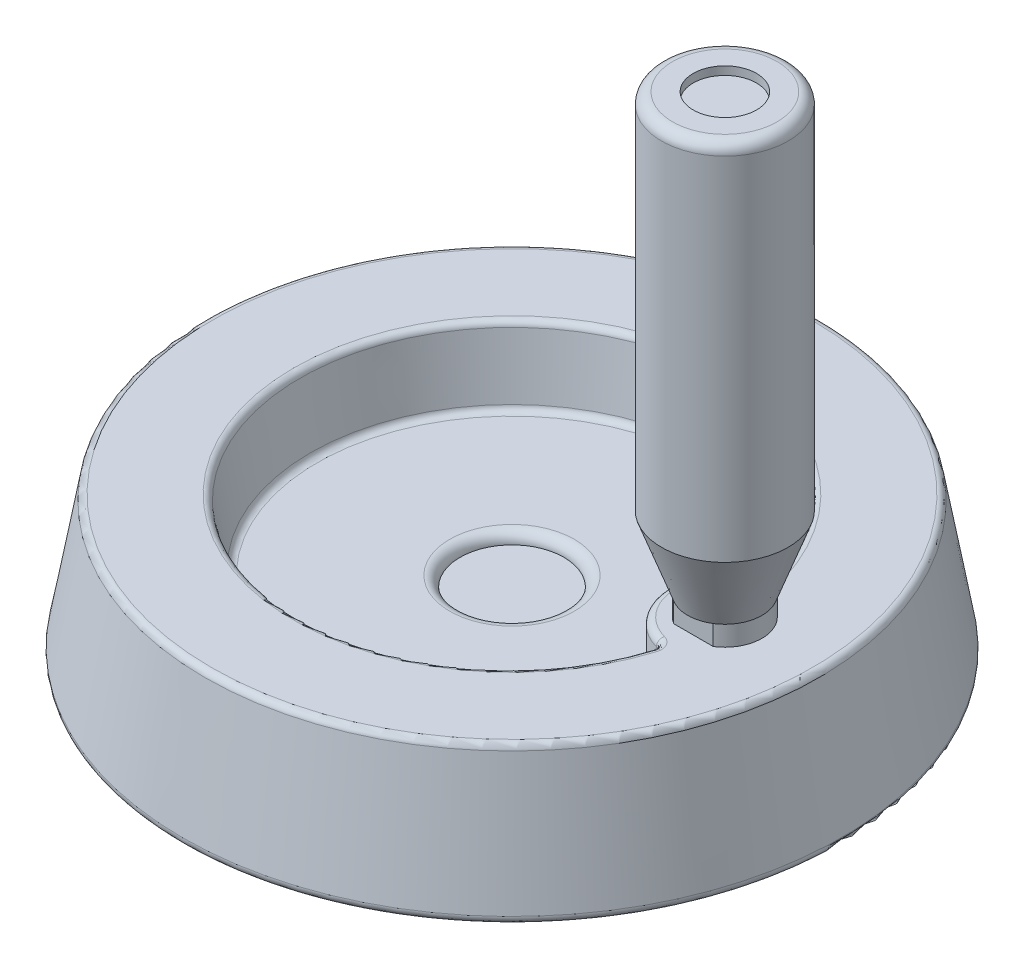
ISO-10303-21;
HEADER;
FILE_DESCRIPTION(('STEP AP214'),'2;1');
FILE_NAME('part.step','',(''),(''),'','','');
FILE_SCHEMA(('AUTOMOTIVE_DESIGN { 1 0 10303 214 1 1 1 1 }'));
ENDSEC;
DATA;
#1=APPLICATION_CONTEXT('core data for automotive mechanical design processes');
#2=APPLICATION_PROTOCOL_DEFINITION('international standard','automotive_design',2000,#1);
#3=PRODUCT_CONTEXT('',#1,'mechanical');
#4=PRODUCT('Part','Part','',(#3));
#5=PRODUCT_RELATED_PRODUCT_CATEGORY('part','',(#4));
#6=PRODUCT_DEFINITION_FORMATION('','',#4);
#7=PRODUCT_DEFINITION_CONTEXT('part definition',#1,'design');
#8=PRODUCT_DEFINITION('design','',#6,#7);
#9=PRODUCT_DEFINITION_SHAPE('','',#8);
#10=(LENGTH_UNIT() NAMED_UNIT(*) SI_UNIT(.MILLI.,.METRE.));
#11=(NAMED_UNIT(*) PLANE_ANGLE_UNIT() SI_UNIT($,.RADIAN.));
#12=(NAMED_UNIT(*) SI_UNIT($,.STERADIAN.) SOLID_ANGLE_UNIT());
#13=UNCERTAINTY_MEASURE_WITH_UNIT(LENGTH_MEASURE(1.E-05),#10,'distance_accuracy_value','');
#14=(GEOMETRIC_REPRESENTATION_CONTEXT(3) GLOBAL_UNCERTAINTY_ASSIGNED_CONTEXT((#13)) GLOBAL_UNIT_ASSIGNED_CONTEXT((#10,
#11,#12)) REPRESENTATION_CONTEXT('',''));
#15=CARTESIAN_POINT('',(0.,0.,0.));
#16=DIRECTION('',(0.,0.,1.));
#17=DIRECTION('',(1.,0.,0.));
#18=AXIS2_PLACEMENT_3D('',#15,#16,#17);
#19=CARTESIAN_POINT('',(25.7353062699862,33.,0.));
#20=DIRECTION('',(0.,1.,0.));
#21=DIRECTION('',(0.,0.,1.));
#22=AXIS2_PLACEMENT_3D('',#19,#20,#21);
#23=PLANE('',#22);
#24=CARTESIAN_POINT('',(21.5847672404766,13.9530931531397,-5.90084884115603));
#25=CARTESIAN_POINT('',(21.7255474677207,13.9944428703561,-5.41353633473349));
#26=CARTESIAN_POINT('',(21.3473219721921,14.0920116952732,-5.0873030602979));
#27=CARTESIAN_POINT('',(21.6753376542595,14.5687618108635,-5.98120174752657));
#28=CARTESIAN_POINT('',(21.8203482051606,14.6125376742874,-5.48467132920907));
#29=CARTESIAN_POINT('',(21.4287000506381,14.7076803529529,-5.15747863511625));
#30=CARTESIAN_POINT('',(21.7666697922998,15.1847161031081,-6.0582686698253));
#31=CARTESIAN_POINT('',(21.9153418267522,15.227372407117,-5.5521213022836));
#32=CARTESIAN_POINT('',(21.5107299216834,15.3236346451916,-5.2248449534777));
#33=CARTESIAN_POINT('',(21.9508422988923,16.4170914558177,-6.20626850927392));
#34=CARTESIAN_POINT('',(22.1067441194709,16.4574262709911,-5.68097172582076));
#35=CARTESIAN_POINT('',(21.676081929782,16.5560099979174,-5.35432706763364));
#36=CARTESIAN_POINT('',(22.0436826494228,17.0335125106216,-6.27720149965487));
#37=CARTESIAN_POINT('',(22.2031715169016,17.0726627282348,-5.74230195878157));
#38=CARTESIAN_POINT('',(21.7594040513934,17.1724310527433,-5.41644292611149));
#39=CARTESIAN_POINT('',(22.3244359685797,18.8832719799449,-6.48145161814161));
#40=CARTESIAN_POINT('',(22.4963074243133,18.9298920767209,-5.9188579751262));
#41=CARTESIAN_POINT('',(22.0112853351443,19.0221905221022,-5.59546249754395));
#42=CARTESIAN_POINT('',(22.5145913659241,20.1171757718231,-6.60622880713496));
#43=CARTESIAN_POINT('',(22.6935022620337,20.1614409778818,-6.02414497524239));
#44=CARTESIAN_POINT('',(22.1817685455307,20.2560943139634,-5.70504599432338));
#45=CARTESIAN_POINT('',(22.9005964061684,22.5846751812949,-6.83508977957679));
#46=CARTESIAN_POINT('',(23.0931206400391,22.6236853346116,-6.21404632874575));
#47=CARTESIAN_POINT('',(22.527627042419,22.7235937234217,-5.90642161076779));
#48=CARTESIAN_POINT('',(23.0964402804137,23.8182699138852,-6.9391937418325));
#49=CARTESIAN_POINT('',(23.2957203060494,23.8546556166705,-6.29817691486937));
#50=CARTESIAN_POINT('',(22.7029973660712,23.9571884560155,-5.99823107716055));
#51=CARTESIAN_POINT('',(23.4939329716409,26.2859884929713,-7.12808793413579));
#52=CARTESIAN_POINT('',(23.7062493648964,26.3164515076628,-6.44677528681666));
#53=CARTESIAN_POINT('',(23.0587452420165,26.4249070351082,-6.16519930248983));
#54=CARTESIAN_POINT('',(23.695581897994,27.5201123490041,-7.21287780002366));
#55=CARTESIAN_POINT('',(23.9143796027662,27.5476207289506,-6.51073686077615));
#56=CARTESIAN_POINT('',(23.2391228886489,27.659030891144,-6.24035774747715));
#57=CARTESIAN_POINT('',(24.1046018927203,29.9884502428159,-7.36372818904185));
#58=CARTESIAN_POINT('',(24.3358540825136,30.0091822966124,-6.61924499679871));
#59=CARTESIAN_POINT('',(23.6048254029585,30.127368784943,-6.3744832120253));
#60=CARTESIAN_POINT('',(24.3119725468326,31.2226642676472,-7.42979006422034));
#61=CARTESIAN_POINT('',(24.5494290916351,31.2400418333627,-6.66326565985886));
#62=CARTESIAN_POINT('',(23.7901499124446,31.3615828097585,-6.43345140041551));
#63=CARTESIAN_POINT('',(24.7323858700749,33.6909729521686,-7.54327383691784));
#64=CARTESIAN_POINT('',(24.9816926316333,33.7005083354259,-6.73163140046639));
#65=CARTESIAN_POINT('',(24.1657140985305,33.8298914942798,-6.53523308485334));
#66=CARTESIAN_POINT('',(24.94542846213,34.9250676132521,-7.59069598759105));
#67=CARTESIAN_POINT('',(25.2006488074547,34.9307278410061,-6.75540418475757));
#68=CARTESIAN_POINT('',(24.3559537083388,35.0639861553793,-6.57804680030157));
#69=CARTESIAN_POINT('',(25.3773385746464,37.394100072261,-7.66662386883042));
#70=CARTESIAN_POINT('',(25.6437910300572,37.3906670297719,-6.78255488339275));
#71=CARTESIAN_POINT('',(24.7414961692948,37.5330186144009,-6.64724463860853));
#72=CARTESIAN_POINT('',(25.5962116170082,38.629037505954,-7.69511095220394));
#73=CARTESIAN_POINT('',(25.8682897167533,38.6211430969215,-6.78526513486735));
#74=CARTESIAN_POINT('',(24.9368038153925,38.7679560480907,-6.67361256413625));
#75=CARTESIAN_POINT('',(26.0395156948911,41.0982807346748,-7.73224484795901));
#76=CARTESIAN_POINT('',(26.3220846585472,41.0793852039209,-6.76897891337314));
#77=CARTESIAN_POINT('',(25.3322541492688,41.2371992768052,-6.70908152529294));
#78=CARTESIAN_POINT('',(26.2639468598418,42.3325865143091,-7.74089119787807));
#79=CARTESIAN_POINT('',(26.551753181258,42.3081736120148,-6.74922304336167));
#80=CARTESIAN_POINT('',(25.5323969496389,42.4715050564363,-6.71818215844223));
#81=CARTESIAN_POINT('',(26.4911191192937,43.5664173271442,-7.73919186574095));
#82=CARTESIAN_POINT('',(26.7796255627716,43.5134308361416,-6.71832178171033));
#83=CARTESIAN_POINT('',(25.7349286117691,43.7053358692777,-6.71826305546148));
#84=(BOUNDED_SURFACE() B_SPLINE_SURFACE(3,2,((#24,#25,#26),(#27,#28,#29),(#30,#31,#32),(#33,#34,
#35),(#36,#37,#38),(#39,#40,#41),(#42,#43,#44),(#45,#46,#47),(#48,#49,#50),(#51,#52,#53),(#54,
#55,#56),(#57,#58,#59),(#60,#61,#62),(#63,#64,#65),(#66,#67,#68),(#69,#70,#71),(#72,#73,#74),
(#75,#76,#77),(#78,#79,#80),(#81,#82,#83)),.UNSPECIFIED.,.F.,.F.,
.F.) B_SPLINE_SURFACE_WITH_KNOTS((4,2,2,2,2,2,2,2,2,4),(3,3),(0.,1.88188733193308,
3.76375219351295,7.52727085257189,11.2870977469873,15.0469955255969,18.8066217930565,
22.5661969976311,26.3294691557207,30.092829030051),(0.,1.),
.UNSPECIFIED.) GEOMETRIC_REPRESENTATION_ITEM() RATIONAL_B_SPLINE_SURFACE(((1.,0.84374181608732,
1.),(1.,0.838897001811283,1.),(1.,0.834049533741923,1.),(1.,0.824346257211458,1.),(1.,
0.819490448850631,1.),(1.,0.804906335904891,1.),(1.,0.795160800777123,1.),(1.,0.775605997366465,
1.),(1.,0.765796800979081,1.),(1.,0.746073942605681,1.),(1.,0.736160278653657,1.),(1.,
0.716194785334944,1.),(1.,0.706142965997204,1.),(1.,0.685861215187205,1.),(1.,0.675631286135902,
1.),(1.,0.654938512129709,1.),(1.,0.644475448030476,1.),(1.,0.623270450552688,1.),(1.,
0.612528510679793,1.),(1.,0.601619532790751,1.))) REPRESENTATION_ITEM('') SURFACE());
#85=CARTESIAN_POINT('',(24.3820108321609,32.3300599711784,-7.7171485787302));
#86=CARTESIAN_POINT('',(24.4710086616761,33.,-7.78244779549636));
#87=CARTESIAN_POINT('',(25.0184356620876,33.,-8.18410426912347));
#88=CARTESIAN_POINT('',(24.4087235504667,32.3327684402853,-7.68156445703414));
#89=CARTESIAN_POINT('',(24.5029104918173,33.,-7.74310844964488));
#90=CARTESIAN_POINT('',(25.0709397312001,33.,-8.11268325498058));
#91=CARTESIAN_POINT('',(24.4322670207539,32.334873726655,-7.64371178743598));
#92=CARTESIAN_POINT('',(24.5310632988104,33.,-7.70051736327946));
#93=CARTESIAN_POINT('',(25.1173103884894,33.,-8.03678151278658));
#94=CARTESIAN_POINT('',(24.4724702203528,32.337838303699,-7.56464062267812));
#95=CARTESIAN_POINT('',(24.5788614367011,33.,-7.61083198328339));
#96=CARTESIAN_POINT('',(25.1967080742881,33.,-7.87836267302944));
#97=CARTESIAN_POINT('',(24.4891351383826,32.3386985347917,-7.52342469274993));
#98=CARTESIAN_POINT('',(24.5985583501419,33.,-7.56368868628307));
#99=CARTESIAN_POINT('',(25.2297451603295,33.,-7.79585061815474));
#100=CARTESIAN_POINT('',(24.5151278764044,32.3391384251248,-7.43857810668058));
#101=CARTESIAN_POINT('',(24.6286798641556,33.,-7.46637989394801));
#102=CARTESIAN_POINT('',(25.2815809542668,33.,-7.62611644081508));
#103=CARTESIAN_POINT('',(24.5244272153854,32.3387131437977,-7.39493876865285));
#104=CARTESIAN_POINT('',(24.639091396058,33.,-7.41613721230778));
#105=CARTESIAN_POINT('',(25.3003243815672,33.,-7.53887741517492));
#106=CARTESIAN_POINT('',(24.5353319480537,32.3365827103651,-7.30665672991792));
#107=CARTESIAN_POINT('',(24.6501867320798,33.,-7.31473068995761));
#108=CARTESIAN_POINT('',(25.3228587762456,33.,-7.3625119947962));
#109=CARTESIAN_POINT('',(24.5369389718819,32.3348778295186,-7.26201424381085));
#110=CARTESIAN_POINT('',(24.6508691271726,33.,-7.26349661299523));
#111=CARTESIAN_POINT('',(25.3266529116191,33.,-7.27338600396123));
#112=CARTESIAN_POINT('',(24.5324408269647,32.3302375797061,-7.17299742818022));
#113=CARTESIAN_POINT('',(24.6425919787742,33.,-7.16203002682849));
#114=CARTESIAN_POINT('',(25.3192353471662,33.,-7.0957854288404));
#115=CARTESIAN_POINT('',(24.5263375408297,32.3273025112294,-7.12862303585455));
#116=CARTESIAN_POINT('',(24.6336052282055,33.,-7.11173214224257));
#117=CARTESIAN_POINT('',(25.3080273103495,33.,-7.00731069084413));
#118=CARTESIAN_POINT('',(24.5066353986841,32.3202882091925,-7.04137179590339));
#119=CARTESIAN_POINT('',(24.6065001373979,33.,-7.01395914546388));
#120=CARTESIAN_POINT('',(25.2710092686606,33.,-6.83346376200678));
#121=CARTESIAN_POINT('',(24.4930354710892,32.3162088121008,-6.99849516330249));
#122=CARTESIAN_POINT('',(24.5883285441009,33.,-6.96643342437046));
#123=CARTESIAN_POINT('',(25.2451971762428,33.,-6.74809201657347));
#124=CARTESIAN_POINT('',(24.4586623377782,32.3069967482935,-6.91516772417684));
#125=CARTESIAN_POINT('',(24.5435983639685,33.,-6.87559308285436));
#126=CARTESIAN_POINT('',(25.1795841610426,33.,-6.58229993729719));
#127=CARTESIAN_POINT('',(24.4378454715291,32.3018577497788,-6.87473348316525));
#128=CARTESIAN_POINT('',(24.51692062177,33.,-6.83227699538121));
#129=CARTESIAN_POINT('',(25.1396980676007,33.,-6.50191333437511));
#130=CARTESIAN_POINT('',(24.3896881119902,32.2906920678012,-6.79767701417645));
#131=CARTESIAN_POINT('',(24.4564409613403,33.,-6.75162353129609));
#132=CARTESIAN_POINT('',(25.0471803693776,33.,-6.34884873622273));
#133=CARTESIAN_POINT('',(24.3623473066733,32.2846653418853,-6.7610549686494));
#134=CARTESIAN_POINT('',(24.4225621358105,33.,-6.71428139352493));
#135=CARTESIAN_POINT('',(24.9945481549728,33.,-6.27617110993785));
#136=CARTESIAN_POINT('',(24.3015027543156,32.2718043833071,-6.69210177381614));
#137=CARTESIAN_POINT('',(24.3486222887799,33.,-6.64620239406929));
#138=CARTESIAN_POINT('',(24.8772313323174,33.,-6.13947608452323));
#139=CARTESIAN_POINT('',(24.2679165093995,32.264959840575,-6.65983943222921));
#140=CARTESIAN_POINT('',(24.3084064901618,33.,-6.61559341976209));
#141=CARTESIAN_POINT('',(24.8123852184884,33.,-6.07559730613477));
#142=CARTESIAN_POINT('',(24.1958170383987,32.2507304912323,-6.60109258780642));
#143=CARTESIAN_POINT('',(24.2238687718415,33.,-6.56245576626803));
#144=CARTESIAN_POINT('',(24.6730224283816,33.,-5.95944818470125));
#145=CARTESIAN_POINT('',(24.1573035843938,32.243345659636,-6.5746083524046));
#146=CARTESIAN_POINT('',(24.1794810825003,33.,-6.53997542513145));
#147=CARTESIAN_POINT('',(24.598505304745,33.,-5.90717837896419));
#148=CARTESIAN_POINT('',(24.0758581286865,32.2281374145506,-6.5277877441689));
#149=CARTESIAN_POINT('',(24.0877387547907,33.,-6.50322489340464));
#150=CARTESIAN_POINT('',(24.4407815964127,33.,-5.81497984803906));
#151=CARTESIAN_POINT('',(24.0328717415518,32.2203093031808,-6.50754278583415));
#152=CARTESIAN_POINT('',(24.0403103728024,33.,-6.48914664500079));
#153=CARTESIAN_POINT('',(24.3574678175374,33.,-5.775234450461));
#154=CARTESIAN_POINT('',(23.9441454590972,32.2045336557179,-6.47425304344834));
#155=CARTESIAN_POINT('',(23.9448947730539,33.,-6.46967545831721));
#156=CARTESIAN_POINT('',(24.1853733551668,33.,-5.71015700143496));
#157=CARTESIAN_POINT('',(23.8984050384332,32.1965860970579,-6.4612096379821));
#158=CARTESIAN_POINT('',(23.8968882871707,33.,-6.4643665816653));
#159=CARTESIAN_POINT('',(24.0965916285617,33.,-5.68482770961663));
#160=CARTESIAN_POINT('',(23.8051121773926,32.1807415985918,-6.44263577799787));
#161=CARTESIAN_POINT('',(23.801717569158,33.,-6.46202958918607));
#162=CARTESIAN_POINT('',(23.9153857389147,33.,-5.64919463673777));
#163=CARTESIAN_POINT('',(23.7575489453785,32.1728454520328,-6.43716087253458));
#164=CARTESIAN_POINT('',(23.754577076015,33.,-6.46514763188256));
#165=CARTESIAN_POINT('',(23.8229397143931,33.,-5.63900191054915));
#166=CARTESIAN_POINT('',(23.6622445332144,32.1573845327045,-6.43403512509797));
#167=CARTESIAN_POINT('',(23.6628964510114,33.,-6.47897631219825));
#168=CARTESIAN_POINT('',(23.6375784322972,33.,-5.63423486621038));
#169=CARTESIAN_POINT('',(23.6145032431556,32.1498200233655,-6.4363903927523));
#170=CARTESIAN_POINT('',(23.6183991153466,33.,-6.48976834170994));
#171=CARTESIAN_POINT('',(23.5446628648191,33.,-5.63967274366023));
#172=CARTESIAN_POINT('',(23.5673697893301,32.1425385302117,-6.44273140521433));
#173=CARTESIAN_POINT('',(23.5762304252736,33.,-6.50383923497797));
#174=CARTESIAN_POINT('',(23.4528666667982,33.,-5.65305475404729));
#175=(BOUNDED_SURFACE() B_SPLINE_SURFACE(3,2,((#85,#86,#87),(#88,#89,#90),(#91,#92,#93),(#94,
#95,#96),(#97,#98,#99),(#100,#101,#102),(#103,#104,#105),(#106,#107,#108),(#109,#110,#111),
(#112,#113,#114),(#115,#116,#117),(#118,#119,#120),(#121,#122,#123),(#124,#125,#126),(#127,#128,
#129),(#130,#131,#132),(#133,#134,#135),(#136,#137,#138),(#139,#140,#141),(#142,#143,#144),
(#145,#146,#147),(#148,#149,#150),(#151,#152,#153),(#154,#155,#156),(#157,#158,#159),(#160,#161,
#162),(#163,#164,#165),(#166,#167,#168),(#169,#170,#171),(#172,#173,#174)),.UNSPECIFIED.,.F.,
.F.,.F.) B_SPLINE_SURFACE_WITH_KNOTS((4,2,2,2,2,2,2,2,2,2,2,2,2,2,4),(3,3),(0.,
0.265588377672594,0.530976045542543,0.797384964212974,1.06373742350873,1.3300248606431,
1.5963503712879,1.86431603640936,2.13229452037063,2.40410304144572,2.67592414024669,
2.95155679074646,3.22724218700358,3.50494042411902,3.7828553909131),(0.,1.),
.UNSPECIFIED.) GEOMETRIC_REPRESENTATION_ITEM() RATIONAL_B_SPLINE_SURFACE(((1.,0.762422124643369,
1.),(1.,0.763531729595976,1.),(1.,0.76439271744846,1.),(1.,0.765604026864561,1.),(1.,
0.765954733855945,1.),(1.,0.766134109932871,1.),(1.,0.765960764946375,1.),(1.,0.765091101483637,
1.),(1.,0.764394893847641,1.),(1.,0.762495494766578,1.),(1.,0.761292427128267,1.),(1.,
0.758407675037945,1.),(1.,0.756725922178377,1.),(1.,0.752912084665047,1.),(1.,0.750777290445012,
1.),(1.,0.746115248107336,1.),(1.,0.743587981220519,1.),(1.,0.738163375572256,1.),(1.,
0.735261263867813,1.),(1.,0.729188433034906,1.),(1.,0.726017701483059,1.),(1.,0.719442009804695,
1.),(1.,0.716034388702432,1.),(1.,0.709116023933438,1.),(1.,0.705605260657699,1.),(1.,
0.698552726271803,1.),(1.,0.695010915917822,1.),(1.,0.688024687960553,1.),(1.,0.684580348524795,
1.),(1.,0.68123904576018,1.))) REPRESENTATION_ITEM('') SURFACE());
#176=CARTESIAN_POINT('',(23.4528666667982,33.,-5.65305475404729));
#177=CARTESIAN_POINT('',(23.5446628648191,33.,-5.63967274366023));
#178=CARTESIAN_POINT('',(23.6375784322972,33.,-5.63423486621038));
#179=CARTESIAN_POINT('',(23.8229397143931,33.,-5.63900191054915));
#180=CARTESIAN_POINT('',(23.9153857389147,33.,-5.64919463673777));
#181=CARTESIAN_POINT('',(24.0965916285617,33.,-5.68482770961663));
#182=CARTESIAN_POINT('',(24.1853733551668,33.,-5.71015700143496));
#183=CARTESIAN_POINT('',(24.3574678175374,33.,-5.775234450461));
#184=CARTESIAN_POINT('',(24.4407815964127,33.,-5.81497984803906));
#185=CARTESIAN_POINT('',(24.598505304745,33.,-5.90717837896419));
#186=CARTESIAN_POINT('',(24.6730224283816,33.,-5.95944818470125));
#187=CARTESIAN_POINT('',(24.8123852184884,33.,-6.07559730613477));
#188=CARTESIAN_POINT('',(24.8772313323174,33.,-6.13947608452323));
#189=CARTESIAN_POINT('',(24.9945481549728,33.,-6.27617110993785));
#190=CARTESIAN_POINT('',(25.0471803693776,33.,-6.34884873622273));
#191=CARTESIAN_POINT('',(25.1396980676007,33.,-6.50191333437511));
#192=CARTESIAN_POINT('',(25.1795841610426,33.,-6.58229993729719));
#193=CARTESIAN_POINT('',(25.2451971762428,33.,-6.74809201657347));
#194=CARTESIAN_POINT('',(25.2710092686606,33.,-6.83346376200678));
#195=CARTESIAN_POINT('',(25.3080273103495,33.,-7.00731069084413));
#196=CARTESIAN_POINT('',(25.3192353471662,33.,-7.0957854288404));
#197=CARTESIAN_POINT('',(25.3266529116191,33.,-7.27338600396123));
#198=CARTESIAN_POINT('',(25.3228587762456,33.,-7.3625119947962));
#199=CARTESIAN_POINT('',(25.3003243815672,33.,-7.53887741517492));
#200=CARTESIAN_POINT('',(25.2815809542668,33.,-7.62611644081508));
#201=CARTESIAN_POINT('',(25.2297451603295,33.,-7.79585061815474));
#202=CARTESIAN_POINT('',(25.1967080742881,33.,-7.87836267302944));
#203=CARTESIAN_POINT('',(25.1173103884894,33.,-8.03678151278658));
#204=CARTESIAN_POINT('',(25.0709397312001,33.,-8.11268325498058));
#205=CARTESIAN_POINT('',(25.0184356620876,33.,-8.18410426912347));
#206=B_SPLINE_CURVE_WITH_KNOTS('',3,(#176,#177,#178,#179,#180,#181,#182,#183,#184,#185,#186,
#187,#188,#189,#190,#191,#192,#193,#194,#195,#196,#197,#198,#199,#200,#201,#202,#203,#204,#205),
.UNSPECIFIED.,.F.,.F.,(4,2,2,2,2,2,2,2,2,2,2,2,2,2,4),(0.,0.277914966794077,0.555613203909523,
0.831298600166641,1.10693125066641,1.37875234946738,1.65056087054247,1.91853935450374,
2.1865050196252,2.45283053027,2.71911796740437,2.98547042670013,3.25187934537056,
3.5172670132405,3.7828553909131),.UNSPECIFIED.);
#207=CARTESIAN_POINT('',(24.1342286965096,33.,-5.6975774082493));
#208=VERTEX_POINT('',#207);
#209=CARTESIAN_POINT('',(25.2556132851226,33.,-7.71114650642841));
#210=VERTEX_POINT('',#209);
#211=EDGE_CURVE('E251',#208,#210,#206,.T.);
#212=ORIENTED_EDGE('',*,*,#211,.F.);
#213=CARTESIAN_POINT('',(25.7353062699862,33.,0.));
#214=DIRECTION('',(0.,1.,0.));
#215=DIRECTION('',(0.,0.,1.));
#216=AXIS2_PLACEMENT_3D('',#213,#214,#215);
#217=CIRCLE('',#216,5.91826306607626);
#218=CARTESIAN_POINT('',(24.1342286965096,33.,5.6975774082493));
#219=VERTEX_POINT('',#218);
#220=EDGE_CURVE('E42',#208,#219,#217,.T.);
#221=ORIENTED_EDGE('',*,*,#220,.T.);
#222=CARTESIAN_POINT('',(26.4911191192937,43.5664173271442,7.73919186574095));
#223=CARTESIAN_POINT('',(26.7796255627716,43.5134308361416,6.71832178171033));
#224=CARTESIAN_POINT('',(25.7349286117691,43.7053358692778,6.71826305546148));
#225=CARTESIAN_POINT('',(26.2639468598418,42.3325865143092,7.74089119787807));
#226=CARTESIAN_POINT('',(26.551753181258,42.3081736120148,6.74922304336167));
#227=CARTESIAN_POINT('',(25.5323969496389,42.4715050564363,6.71818215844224));
#228=CARTESIAN_POINT('',(26.0395156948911,41.0982807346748,7.73224484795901));
#229=CARTESIAN_POINT('',(26.3220846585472,41.0793852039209,6.76897891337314));
#230=CARTESIAN_POINT('',(25.3322541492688,41.2371992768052,6.70908152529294));
#231=CARTESIAN_POINT('',(25.5962116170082,38.629037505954,7.69511095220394));
#232=CARTESIAN_POINT('',(25.8682897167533,38.6211430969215,6.78526513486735));
#233=CARTESIAN_POINT('',(24.9368038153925,38.7679560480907,6.67361256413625));
#234=CARTESIAN_POINT('',(25.3773385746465,37.394100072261,7.66662386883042));
#235=CARTESIAN_POINT('',(25.6437910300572,37.3906670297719,6.78255488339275));
#236=CARTESIAN_POINT('',(24.7414961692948,37.5330186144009,6.64724463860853));
#237=CARTESIAN_POINT('',(24.94542846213,34.9250676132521,7.59069598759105));
#238=CARTESIAN_POINT('',(25.2006488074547,34.9307278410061,6.75540418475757));
#239=CARTESIAN_POINT('',(24.3559537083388,35.0639861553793,6.57804680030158));
#240=CARTESIAN_POINT('',(24.7323858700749,33.6909729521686,7.54327383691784));
#241=CARTESIAN_POINT('',(24.9816926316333,33.7005083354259,6.73163140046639));
#242=CARTESIAN_POINT('',(24.1657140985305,33.8298914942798,6.53523308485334));
#243=CARTESIAN_POINT('',(24.3119725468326,31.2226642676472,7.42979006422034));
#244=CARTESIAN_POINT('',(24.549429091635,31.2400418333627,6.66326565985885));
#245=CARTESIAN_POINT('',(23.7901499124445,31.3615828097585,6.4334514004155));
#246=CARTESIAN_POINT('',(24.1046018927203,29.9884502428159,7.36372818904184));
#247=CARTESIAN_POINT('',(24.3358540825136,30.0091822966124,6.6192449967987));
#248=CARTESIAN_POINT('',(23.6048254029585,30.127368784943,6.37448321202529));
#249=CARTESIAN_POINT('',(23.695581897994,27.5201123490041,7.21287780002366));
#250=CARTESIAN_POINT('',(23.9143796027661,27.5476207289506,6.51073686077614));
#251=CARTESIAN_POINT('',(23.2391228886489,27.659030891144,6.24035774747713));
#252=CARTESIAN_POINT('',(23.4939329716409,26.2859884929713,7.12808793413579));
#253=CARTESIAN_POINT('',(23.7062493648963,26.3164515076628,6.44677528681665));
#254=CARTESIAN_POINT('',(23.0587452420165,26.4249070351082,6.16519930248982));
#255=CARTESIAN_POINT('',(23.0964402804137,23.8182699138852,6.9391937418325));
#256=CARTESIAN_POINT('',(23.2957203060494,23.8546556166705,6.29817691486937));
#257=CARTESIAN_POINT('',(22.7029973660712,23.9571884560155,5.99823107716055));
#258=CARTESIAN_POINT('',(22.9005964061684,22.5846751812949,6.8350897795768));
#259=CARTESIAN_POINT('',(23.0931206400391,22.6236853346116,6.21404632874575));
#260=CARTESIAN_POINT('',(22.527627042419,22.7235937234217,5.9064216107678));
#261=CARTESIAN_POINT('',(22.5145913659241,20.1171757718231,6.60622880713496));
#262=CARTESIAN_POINT('',(22.6935022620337,20.1614409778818,6.02414497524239));
#263=CARTESIAN_POINT('',(22.1817685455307,20.2560943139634,5.70504599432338));
#264=CARTESIAN_POINT('',(22.3244359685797,18.8832719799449,6.48145161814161));
#265=CARTESIAN_POINT('',(22.4963074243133,18.9298920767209,5.9188579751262));
#266=CARTESIAN_POINT('',(22.0112853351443,19.0221905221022,5.59546249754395));
#267=CARTESIAN_POINT('',(22.0436826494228,17.0335125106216,6.27720149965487));
#268=CARTESIAN_POINT('',(22.2031715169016,17.0726627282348,5.74230195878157));
#269=CARTESIAN_POINT('',(21.7594040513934,17.1724310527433,5.4164429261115));
#270=CARTESIAN_POINT('',(21.9508422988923,16.4170914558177,6.20626850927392));
#271=CARTESIAN_POINT('',(22.1067441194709,16.4574262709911,5.68097172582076));
#272=CARTESIAN_POINT('',(21.676081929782,16.5560099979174,5.35432706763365));
#273=CARTESIAN_POINT('',(21.7666697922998,15.1847161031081,6.0582686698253));
#274=CARTESIAN_POINT('',(21.9153418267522,15.227372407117,5.5521213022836));
#275=CARTESIAN_POINT('',(21.5107299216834,15.3236346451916,5.2248449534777));
#276=CARTESIAN_POINT('',(21.6753376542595,14.5687618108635,5.98120174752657));
#277=CARTESIAN_POINT('',(21.8203482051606,14.6125376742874,5.48467132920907));
#278=CARTESIAN_POINT('',(21.4287000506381,14.7076803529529,5.15747863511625));
#279=CARTESIAN_POINT('',(21.5847672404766,13.9530931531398,5.90084884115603));
#280=CARTESIAN_POINT('',(21.7255474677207,13.9944428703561,5.41353633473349));
#281=CARTESIAN_POINT('',(21.3473219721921,14.0920116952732,5.0873030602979));
#282=(BOUNDED_SURFACE() B_SPLINE_SURFACE(3,2,((#222,#223,#224),(#225,#226,#227),(#228,#229,
#230),(#231,#232,#233),(#234,#235,#236),(#237,#238,#239),(#240,#241,#242),(#243,#244,#245),
(#246,#247,#248),(#249,#250,#251),(#252,#253,#254),(#255,#256,#257),(#258,#259,#260),(#261,#262,
#263),(#264,#265,#266),(#267,#268,#269),(#270,#271,#272),(#273,#274,#275),(#276,#277,#278),
(#279,#280,#281)),.UNSPECIFIED.,.F.,.F.,.F.) B_SPLINE_SURFACE_WITH_KNOTS((4,2,2,2,2,2,2,2,2,4),
(3,3),(0.,3.76335987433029,7.52663203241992,11.2862072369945,15.0458335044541,18.8057312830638,
22.5655581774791,26.3290768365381,28.2109416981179,30.092829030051),(0.,1.),
.UNSPECIFIED.) GEOMETRIC_REPRESENTATION_ITEM() RATIONAL_B_SPLINE_SURFACE(((1.,0.601619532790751,
1.),(1.,0.612528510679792,1.),(1.,0.623270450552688,1.),(1.,0.644475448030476,1.),(1.,
0.65493851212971,1.),(1.,0.675631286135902,1.),(1.,0.685861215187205,1.),(1.,0.706142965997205,
1.),(1.,0.716194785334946,1.),(1.,0.736160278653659,1.),(1.,0.746073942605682,1.),(1.,
0.76579680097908,1.),(1.,0.775605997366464,1.),(1.,0.795160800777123,1.),(1.,0.804906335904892,
1.),(1.,0.819490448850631,1.),(1.,0.824346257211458,1.),(1.,0.834049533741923,1.),(1.,
0.838897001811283,1.),(1.,0.84374181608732,1.))) REPRESENTATION_ITEM('') SURFACE());
#283=CARTESIAN_POINT('',(23.6339841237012,32.1529540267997,6.43645111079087));
#284=CARTESIAN_POINT('',(23.6371970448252,33.,6.48624527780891));
#285=CARTESIAN_POINT('',(23.582561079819,33.,5.63949172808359));
#286=CARTESIAN_POINT('',(23.6816360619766,32.160489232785,6.43378514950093));
#287=CARTESIAN_POINT('',(23.6811750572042,33.,6.47535834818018));
#288=CARTESIAN_POINT('',(23.6753076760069,33.,5.63343650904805));
#289=CARTESIAN_POINT('',(23.7295713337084,32.1682561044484,6.43513897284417));
#290=CARTESIAN_POINT('',(23.7272318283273,33.,6.46806278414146));
#291=CARTESIAN_POINT('',(23.7685421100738,33.,5.6353987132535));
#292=CARTESIAN_POINT('',(23.8246263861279,32.1840160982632,6.4456529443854));
#293=CARTESIAN_POINT('',(23.8213335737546,33.,6.46166408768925));
#294=CARTESIAN_POINT('',(23.9533023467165,33.,5.65491634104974));
#295=CARTESIAN_POINT('',(23.8717467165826,32.1920090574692,6.45480760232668));
#296=CARTESIAN_POINT('',(23.8693497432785,33.,6.46247348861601));
#297=CARTESIAN_POINT('',(24.0448293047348,33.,5.67246079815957));
#298=CARTESIAN_POINT('',(23.9636488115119,32.2079586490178,6.48062741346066));
#299=CARTESIAN_POINT('',(23.9655580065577,33.,6.47293877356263));
#300=CARTESIAN_POINT('',(24.2232171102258,33.,5.72257855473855));
#301=CARTESIAN_POINT('',(24.008440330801,32.2159152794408,6.49725784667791));
#302=CARTESIAN_POINT('',(24.0137493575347,33.,6.48246775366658));
#303=CARTESIAN_POINT('',(24.3100974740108,33.,5.75508239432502));
#304=CARTESIAN_POINT('',(24.0946447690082,32.231598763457,6.53754564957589));
#305=CARTESIAN_POINT('',(24.1086161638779,33.,6.51051272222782));
#306=CARTESIAN_POINT('',(24.4771786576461,33.,5.83416755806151));
#307=CARTESIAN_POINT('',(24.1360582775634,32.2393256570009,6.56120178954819));
#308=CARTESIAN_POINT('',(24.1553254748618,33.,6.52894812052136));
#309=CARTESIAN_POINT('',(24.5573806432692,33.,5.88074641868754));
#310=CARTESIAN_POINT('',(24.214342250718,32.2543301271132,6.61491284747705));
#311=CARTESIAN_POINT('',(24.2453205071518,33.,6.57459944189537));
#312=CARTESIAN_POINT('',(24.7088498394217,33.,5.98674779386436));
#313=CARTESIAN_POINT('',(24.2512107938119,32.261607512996,6.64497045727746));
#314=CARTESIAN_POINT('',(24.2886643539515,33.,6.60175683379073));
#315=CARTESIAN_POINT('',(24.7801132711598,33.,6.04617571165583));
#316=CARTESIAN_POINT('',(24.3192968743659,32.2754945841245,6.71065327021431));
#317=CARTESIAN_POINT('',(24.3700073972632,33.,6.6641774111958));
#318=CARTESIAN_POINT('',(24.9115648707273,33.,6.17623145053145));
#319=CARTESIAN_POINT('',(24.3505145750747,32.2821042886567,6.74627831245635));
#320=CARTESIAN_POINT('',(24.4080840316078,33.,6.69940283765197));
#321=CARTESIAN_POINT('',(24.9717533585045,33.,6.24685894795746));
#322=CARTESIAN_POINT('',(24.4061455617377,32.2944120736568,6.8218258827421));
#323=CARTESIAN_POINT('',(24.4769035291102,33.,6.7765797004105));
#324=CARTESIAN_POINT('',(25.0788305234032,33.,6.39679677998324));
#325=CARTESIAN_POINT('',(24.4306063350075,32.3001163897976,6.86171553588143));
#326=CARTESIAN_POINT('',(24.5077790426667,33.,6.81847093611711));
#327=CARTESIAN_POINT('',(25.1258120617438,33.,6.47604076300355));
#328=CARTESIAN_POINT('',(24.4722538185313,32.3104969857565,6.94487315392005));
#329=CARTESIAN_POINT('',(24.5610969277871,33.,6.90769721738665));
#330=CARTESIAN_POINT('',(25.2055765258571,33.,6.641382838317));
#331=CARTESIAN_POINT('',(24.4894409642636,32.3151733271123,6.98814091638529));
#332=CARTESIAN_POINT('',(24.5836192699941,33.,6.95505341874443));
#333=CARTESIAN_POINT('',(25.2383603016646,33.,6.72748051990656));
#334=CARTESIAN_POINT('',(24.5157818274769,32.3232927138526,7.07614372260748));
#335=CARTESIAN_POINT('',(24.6188677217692,33.,7.05271166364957));
#336=CARTESIAN_POINT('',(25.2882801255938,33.,6.90272666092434));
#337=CARTESIAN_POINT('',(24.5250502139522,32.3267529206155,7.1208477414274));
#338=CARTESIAN_POINT('',(24.6317951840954,33.,7.10300279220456));
#339=CARTESIAN_POINT('',(25.3056396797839,33.,6.99181145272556));
#340=CARTESIAN_POINT('',(24.5356611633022,32.3324290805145,7.21102127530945));
#341=CARTESIAN_POINT('',(24.6477403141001,33.,7.20523007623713));
#342=CARTESIAN_POINT('',(25.3249304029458,33.,7.17162854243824));
#343=CARTESIAN_POINT('',(24.5370050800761,32.334645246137,7.25649065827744));
#344=CARTESIAN_POINT('',(24.6508005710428,33.,7.25722975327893));
#345=CARTESIAN_POINT('',(25.3268642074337,33.,7.26236055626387));
#346=CARTESIAN_POINT('',(24.5317331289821,32.3377457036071,7.34624743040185));
#347=CARTESIAN_POINT('',(24.6468341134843,33.,7.36014653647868));
#348=CARTESIAN_POINT('',(25.3152654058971,33.,7.44158493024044));
#349=CARTESIAN_POINT('',(24.5252255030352,32.3386477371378,7.39054248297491));
#350=CARTESIAN_POINT('',(24.6399579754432,33.,7.41113836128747));
#351=CARTESIAN_POINT('',(25.3019432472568,33.,7.53009096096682));
#352=CARTESIAN_POINT('',(24.5046054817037,32.3391533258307,7.47732156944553));
#353=CARTESIAN_POINT('',(24.6166147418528,33.,7.51083283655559));
#354=CARTESIAN_POINT('',(25.2605311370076,33.,7.70360198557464));
#355=CARTESIAN_POINT('',(24.4904915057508,32.3387566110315,7.51980522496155));
#356=CARTESIAN_POINT('',(24.6001320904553,33.,7.55960457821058));
#357=CARTESIAN_POINT('',(25.2324381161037,33.,7.78860624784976));
#358=CARTESIAN_POINT('',(24.4551795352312,32.3366856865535,7.6014465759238));
#359=CARTESIAN_POINT('',(24.5583693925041,33.,7.65267392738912));
#360=CARTESIAN_POINT('',(25.1625188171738,33.,7.95208204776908));
#361=CARTESIAN_POINT('',(24.4340296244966,32.3350200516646,7.64062464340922));
#362=CARTESIAN_POINT('',(24.5331108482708,33.,7.69705815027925));
#363=CARTESIAN_POINT('',(25.1207857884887,33.,8.0305935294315));
#364=CARTESIAN_POINT('',(24.3852680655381,32.3304823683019,7.71492761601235));
#365=CARTESIAN_POINT('',(24.4748771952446,33.,7.7802329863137));
#366=CARTESIAN_POINT('',(25.0248065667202,33.,8.1796229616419));
#367=CARTESIAN_POINT('',(24.3576522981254,32.3276095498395,7.75004991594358));
#368=CARTESIAN_POINT('',(24.4418403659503,33.,7.81906054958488));
#369=CARTESIAN_POINT('',(24.9705523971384,33.,8.2501357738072));
#370=CARTESIAN_POINT('',(24.327140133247,32.3241647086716,7.78259713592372));
#371=CARTESIAN_POINT('',(24.4055432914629,33.,7.85420137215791));
#372=CARTESIAN_POINT('',(24.9106998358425,33.,8.31555202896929));
#373=(BOUNDED_SURFACE() B_SPLINE_SURFACE(3,2,((#283,#284,#285),(#286,#287,#288),(#289,#290,
#291),(#292,#293,#294),(#295,#296,#297),(#298,#299,#300),(#301,#302,#303),(#304,#305,#306),
(#307,#308,#309),(#310,#311,#312),(#313,#314,#315),(#316,#317,#318),(#319,#320,#321),(#322,#323,
#324),(#325,#326,#327),(#328,#329,#330),(#331,#332,#333),(#334,#335,#336),(#337,#338,#339),
(#340,#341,#342),(#343,#344,#345),(#346,#347,#348),(#349,#350,#351),(#352,#353,#354),(#355,#356,
#357),(#358,#359,#360),(#361,#362,#363),(#364,#365,#366),(#367,#368,#369),(#370,#371,#372)),
.UNSPECIFIED.,.F.,.F.,.F.) B_SPLINE_SURFACE_WITH_KNOTS((4,2,2,2,2,2,2,2,2,2,2,2,2,2,4),(3,3),
(0.,0.27845136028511,0.556706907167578,0.833683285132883,1.1106112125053,1.38765581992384,
1.66469242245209,1.93972939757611,2.21474990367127,2.48571695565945,2.7566377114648,
3.02386582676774,3.29114949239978,3.55664282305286,3.82230575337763),(0.,1.),
.UNSPECIFIED.) GEOMETRIC_REPRESENTATION_ITEM() RATIONAL_B_SPLINE_SURFACE(((1.,0.686000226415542,
1.),(1.,0.689433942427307,1.),(1.,0.692945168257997,1.),(1.,0.700015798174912,1.),(1.,
0.703575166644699,1.),(1.,0.710624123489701,1.),(1.,0.714113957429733,1.),(1.,0.720944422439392,
1.),(1.,0.724285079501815,1.),(1.,0.730730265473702,1.),(1.,0.733834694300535,1.),(1.,
0.73972481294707,1.),(1.,0.742510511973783,1.),(1.,0.747672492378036,1.),(1.,0.750051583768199,
1.),(1.,0.754364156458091,1.),(1.,0.756297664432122,1.),(1.,0.7596451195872,1.),(1.,
0.761066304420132,1.),(1.,0.763393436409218,1.),(1.,0.764299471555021,1.),(1.,0.765566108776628,
1.),(1.,0.765933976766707,1.),(1.,0.766140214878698,1.),(1.,0.76597847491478,1.),(1.,
0.76513318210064,1.),(1.,0.764453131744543,1.),(1.,0.762595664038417,1.),(1.,0.761417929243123,
1.),(1.,0.760001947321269,1.))) REPRESENTATION_ITEM('') SURFACE());
#374=CARTESIAN_POINT('',(24.9106998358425,33.,8.31555202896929));
#375=CARTESIAN_POINT('',(24.9705523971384,33.,8.2501357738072));
#376=CARTESIAN_POINT('',(25.0248065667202,33.,8.1796229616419));
#377=CARTESIAN_POINT('',(25.1207857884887,33.,8.0305935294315));
#378=CARTESIAN_POINT('',(25.1625188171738,33.,7.95208204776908));
#379=CARTESIAN_POINT('',(25.2324381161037,33.,7.78860624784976));
#380=CARTESIAN_POINT('',(25.2605311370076,33.,7.70360198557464));
#381=CARTESIAN_POINT('',(25.3019432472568,33.,7.53009096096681));
#382=CARTESIAN_POINT('',(25.3152654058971,33.,7.44158493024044));
#383=CARTESIAN_POINT('',(25.3268642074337,33.,7.26236055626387));
#384=CARTESIAN_POINT('',(25.3249304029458,33.,7.17162854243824));
#385=CARTESIAN_POINT('',(25.3056396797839,33.,6.99181145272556));
#386=CARTESIAN_POINT('',(25.2882801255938,33.,6.90272666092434));
#387=CARTESIAN_POINT('',(25.2383603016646,33.,6.72748051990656));
#388=CARTESIAN_POINT('',(25.2055765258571,33.,6.641382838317));
#389=CARTESIAN_POINT('',(25.1258120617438,33.,6.47604076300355));
#390=CARTESIAN_POINT('',(25.0788305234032,33.,6.39679677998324));
#391=CARTESIAN_POINT('',(24.9717533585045,33.,6.24685894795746));
#392=CARTESIAN_POINT('',(24.9115648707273,33.,6.17623145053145));
#393=CARTESIAN_POINT('',(24.7801132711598,33.,6.04617571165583));
#394=CARTESIAN_POINT('',(24.7088498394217,33.,5.98674779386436));
#395=CARTESIAN_POINT('',(24.5573806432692,33.,5.88074641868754));
#396=CARTESIAN_POINT('',(24.4771786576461,33.,5.83416755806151));
#397=CARTESIAN_POINT('',(24.3100974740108,33.,5.75508239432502));
#398=CARTESIAN_POINT('',(24.2232171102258,33.,5.72257855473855));
#399=CARTESIAN_POINT('',(24.0448293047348,33.,5.67246079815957));
#400=CARTESIAN_POINT('',(23.9533023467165,33.,5.65491634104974));
#401=CARTESIAN_POINT('',(23.7685421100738,33.,5.6353987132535));
#402=CARTESIAN_POINT('',(23.6753076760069,33.,5.63343650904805));
#403=CARTESIAN_POINT('',(23.582561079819,33.,5.63949172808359));
#404=B_SPLINE_CURVE_WITH_KNOTS('',3,(#374,#375,#376,#377,#378,#379,#380,#381,#382,#383,#384,
#385,#386,#387,#388,#389,#390,#391,#392,#393,#394,#395,#396,#397,#398,#399,#400,#401,#402,#403),
.UNSPECIFIED.,.F.,.F.,(4,2,2,2,2,2,2,2,2,2,2,2,2,2,4),(0.,0.265662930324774,0.531156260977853,
0.79843992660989,1.06566804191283,1.33658879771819,1.60755584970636,1.88257635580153,
2.15761333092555,2.43464993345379,2.71169454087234,2.98862246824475,3.26559884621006,
3.54385439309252,3.82230575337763),.UNSPECIFIED.);
#405=CARTESIAN_POINT('',(25.2556132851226,33.,7.71114650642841));
#406=VERTEX_POINT('',#405);
#407=EDGE_CURVE('E58',#406,#219,#404,.T.);
#408=ORIENTED_EDGE('',*,*,#407,.F.);
#409=CARTESIAN_POINT('',(0.,33.,0.));
#410=DIRECTION('',(0.,1.,0.));
#411=DIRECTION('',(0.,0.,1.));
#412=AXIS2_PLACEMENT_3D('',#409,#410,#411);
#413=CIRCLE('',#412,26.406585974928);
#414=EDGE_CURVE('E259',#406,#210,#413,.F.);
#415=ORIENTED_EDGE('',*,*,#414,.T.);
#416=EDGE_LOOP('',(#212,#221,#408,#415));
#417=FACE_BOUND('',#416,.T.);
#418=CARTESIAN_POINT('',(0.,33.,0.));
#419=DIRECTION('',(0.,1.,0.));
#420=DIRECTION('',(0.,0.,1.));
#421=AXIS2_PLACEMENT_3D('',#418,#419,#420);
#422=CIRCLE('',#421,36.3311616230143);
#423=CARTESIAN_POINT('',(0.,33.,36.3311616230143));
#424=VERTEX_POINT('',#423);
#425=EDGE_CURVE('E11',#424,#424,#422,.T.);
#426=ORIENTED_EDGE('',*,*,#425,.T.);
#427=EDGE_LOOP('',(#426));
#428=FACE_BOUND('',#427,.T.);
#429=DIRECTION('',(1.,0.,0.));
#430=VECTOR('',#429,1.);
#431=CARTESIAN_POINT('',(23.3472996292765,33.,3.79753296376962));
#432=LINE('',#431,#430);
#433=CARTESIAN_POINT('',(23.3472996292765,33.,3.79753296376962));
#434=VERTEX_POINT('',#433);
#435=CARTESIAN_POINT('',(28.1233129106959,33.,3.79753296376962));
#436=VERTEX_POINT('',#435);
#437=EDGE_CURVE('E125',#434,#436,#432,.T.);
#438=ORIENTED_EDGE('',*,*,#437,.F.);
#439=CARTESIAN_POINT('',(25.7353062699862,33.,0.));
#440=DIRECTION('',(0.,1.,0.));
#441=DIRECTION('',(0.,0.,1.));
#442=AXIS2_PLACEMENT_3D('',#439,#440,#441);
#443=CIRCLE('',#442,4.48595946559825);
#444=CARTESIAN_POINT('',(23.3472996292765,33.,-3.79753296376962));
#445=VERTEX_POINT('',#444);
#446=EDGE_CURVE('E165',#445,#434,#443,.T.);
#447=ORIENTED_EDGE('',*,*,#446,.F.);
#448=DIRECTION('',(-1.,0.,0.));
#449=VECTOR('',#448,1.);
#450=CARTESIAN_POINT('',(23.3472996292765,33.,-3.79753296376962));
#451=LINE('',#450,#449);
#452=CARTESIAN_POINT('',(28.1233129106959,33.,-3.79753296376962));
#453=VERTEX_POINT('',#452);
#454=EDGE_CURVE('E158',#453,#445,#451,.T.);
#455=ORIENTED_EDGE('',*,*,#454,.F.);
#456=CARTESIAN_POINT('',(25.7353062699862,33.,0.));
#457=DIRECTION('',(0.,1.,0.));
#458=DIRECTION('',(0.,0.,1.));
#459=AXIS2_PLACEMENT_3D('',#456,#457,#458);
#460=CIRCLE('',#459,4.48595946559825);
#461=EDGE_CURVE('E50',#436,#453,#460,.T.);
#462=ORIENTED_EDGE('',*,*,#461,.F.);
#463=EDGE_LOOP('',(#438,#447,#455,#462));
#464=FACE_BOUND('',#463,.T.);
#465=ADVANCED_FACE('F33',(#417,#428,#464),#23,.T.);
#466=CARTESIAN_POINT('',(0.,0.,0.));
#467=DIRECTION('',(0.,-1.,0.));
#468=DIRECTION('',(0.,0.,-1.));
#469=AXIS2_PLACEMENT_3D('',#466,#467,#468);
#470=CYLINDRICAL_SURFACE('',#469,12.);
#471=CARTESIAN_POINT('',(0.,0.8,0.));
#472=DIRECTION('',(0.,-1.,0.));
#473=DIRECTION('',(0.,0.,-1.));
#474=AXIS2_PLACEMENT_3D('',#471,#472,#473);
#475=CIRCLE('',#474,12.);
#476=CARTESIAN_POINT('',(0.,0.8,-12.));
#477=VERTEX_POINT('',#476);
#478=EDGE_CURVE('E434',#477,#477,#475,.F.);
#479=ORIENTED_EDGE('',*,*,#478,.T.);
#480=EDGE_LOOP('',(#479));
#481=FACE_BOUND('',#480,.T.);
#482=CARTESIAN_POINT('',(0.,21.1847496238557,0.));
#483=DIRECTION('',(0.,-1.,0.));
#484=DIRECTION('',(0.,0.,-1.));
#485=AXIS2_PLACEMENT_3D('',#482,#483,#484);
#486=CIRCLE('',#485,12.);
#487=CARTESIAN_POINT('',(0.,21.1847496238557,-12.));
#488=VERTEX_POINT('',#487);
#489=EDGE_CURVE('E437',#488,#488,#486,.T.);
#490=ORIENTED_EDGE('',*,*,#489,.T.);
#491=EDGE_LOOP('',(#490));
#492=FACE_BOUND('',#491,.T.);
#493=ADVANCED_FACE('F215',(#481,#492),#470,.T.);
#494=CARTESIAN_POINT('',(12.,21.9847496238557,0.));
#495=DIRECTION('',(0.,-1.,0.));
#496=DIRECTION('',(0.,0.,-1.));
#497=AXIS2_PLACEMENT_3D('',#494,#495,#496);
#498=PLANE('',#497);
#499=CARTESIAN_POINT('',(0.,21.9847496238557,0.));
#500=DIRECTION('',(0.,-1.,0.));
#501=DIRECTION('',(0.,0.,-1.));
#502=AXIS2_PLACEMENT_3D('',#499,#500,#501);
#503=CIRCLE('',#502,12.8);
#504=CARTESIAN_POINT('',(0.,21.9847496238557,-12.8));
#505=VERTEX_POINT('',#504);
#506=EDGE_CURVE('E431',#505,#505,#503,.F.);
#507=ORIENTED_EDGE('',*,*,#506,.T.);
#508=EDGE_LOOP('',(#507));
#509=FACE_BOUND('',#508,.T.);
#510=CARTESIAN_POINT('',(0.,21.9847496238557,0.));
#511=DIRECTION('',(0.,-1.,0.));
#512=DIRECTION('',(0.,0.,-1.));
#513=AXIS2_PLACEMENT_3D('',#510,#511,#512);
#514=CIRCLE('',#513,27.8444031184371);
#515=CARTESIAN_POINT('',(0.,21.9847496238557,-27.8444031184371));
#516=VERTEX_POINT('',#515);
#517=EDGE_CURVE('E443',#516,#516,#514,.T.);
#518=ORIENTED_EDGE('',*,*,#517,.T.);
#519=EDGE_LOOP('',(#518));
#520=FACE_BOUND('',#519,.T.);
#521=ADVANCED_FACE('F221',(#509,#520),#498,.T.);
#522=CARTESIAN_POINT('',(0.,21.9847496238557,0.));
#523=DIRECTION('',(0.,1.,0.));
#524=DIRECTION('',(0.,0.,1.));
#525=AXIS2_PLACEMENT_3D('',#522,#523,#524);
#526=CONICAL_SURFACE('',#525,27.8444031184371,0.17453292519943);
#527=CARTESIAN_POINT('',(0.,30.4847496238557,0.));
#528=DIRECTION('',(0.,-1.,0.));
#529=DIRECTION('',(0.,0.,-1.));
#530=AXIS2_PLACEMENT_3D('',#527,#528,#529);
#531=CIRCLE('',#530,29.343182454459);
#532=CARTESIAN_POINT('',(0.,30.4847496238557,-29.343182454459));
#533=VERTEX_POINT('',#532);
#534=EDGE_CURVE('E446',#533,#533,#531,.T.);
#535=ORIENTED_EDGE('',*,*,#534,.T.);
#536=EDGE_LOOP('',(#535));
#537=FACE_BOUND('',#536,.T.);
#538=ORIENTED_EDGE('',*,*,#517,.F.);
#539=EDGE_LOOP('',(#538));
#540=FACE_BOUND('',#539,.T.);
#541=ADVANCED_FACE('F414',(#537,#540),#526,.T.);
#542=CARTESIAN_POINT('',(29.343182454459,30.4847496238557,0.));
#543=DIRECTION('',(0.,-1.,0.));
#544=DIRECTION('',(0.,0.,-1.));
#545=AXIS2_PLACEMENT_3D('',#542,#543,#544);
#546=PLANE('',#545);
#547=CARTESIAN_POINT('',(0.,30.4847496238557,0.));
#548=DIRECTION('',(0.,-1.,0.));
#549=DIRECTION('',(0.,0.,-1.));
#550=AXIS2_PLACEMENT_3D('',#547,#548,#549);
#551=CIRCLE('',#550,33.3945651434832);
#552=CARTESIAN_POINT('',(0.,30.4847496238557,-33.3945651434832));
#553=VERTEX_POINT('',#552);
#554=EDGE_CURVE('E449',#553,#553,#551,.T.);
#555=ORIENTED_EDGE('',*,*,#554,.T.);
#556=EDGE_LOOP('',(#555));
#557=FACE_BOUND('',#556,.T.);
#558=ORIENTED_EDGE('',*,*,#534,.F.);
#559=EDGE_LOOP('',(#558));
#560=FACE_BOUND('',#559,.T.);
#561=ADVANCED_FACE('F408',(#557,#560),#546,.T.);
#562=CARTESIAN_POINT('',(0.,30.4847496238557,0.));
#563=DIRECTION('',(0.,-1.,0.));
#564=DIRECTION('',(0.,0.,-1.));
#565=AXIS2_PLACEMENT_3D('',#562,#563,#564);
#566=CONICAL_SURFACE('',#565,33.3945651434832,0.174532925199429);
#567=CARTESIAN_POINT('',(0.,16.6610814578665,0.));
#568=DIRECTION('',(0.,1.,0.));
#569=DIRECTION('',(0.,0.,1.));
#570=AXIS2_PLACEMENT_3D('',#567,#568,#569);
#571=CIRCLE('',#570,35.8320508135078);
#572=CARTESIAN_POINT('',(0.,16.6610814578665,35.8320508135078));
#573=VERTEX_POINT('',#572);
#574=EDGE_CURVE('E382',#573,#573,#571,.F.);
#575=ORIENTED_EDGE('',*,*,#574,.T.);
#576=EDGE_LOOP('',(#575));
#577=FACE_BOUND('',#576,.T.);
#578=ORIENTED_EDGE('',*,*,#554,.F.);
#579=EDGE_LOOP('',(#578));
#580=FACE_BOUND('',#579,.T.);
#581=ADVANCED_FACE('F403',(#577,#580),#566,.F.);
#582=CARTESIAN_POINT('',(35.9486173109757,16.,0.));
#583=DIRECTION('',(0.,-1.,0.));
#584=DIRECTION('',(0.,0.,-1.));
#585=AXIS2_PLACEMENT_3D('',#582,#583,#584);
#586=PLANE('',#585);
#587=CARTESIAN_POINT('',(0.,16.,0.));
#588=DIRECTION('',(0.,-1.,0.));
#589=DIRECTION('',(0.,0.,-1.));
#590=AXIS2_PLACEMENT_3D('',#587,#588,#589);
#591=CIRCLE('',#590,36.6198970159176);
#592=CARTESIAN_POINT('',(0.,16.,-36.6198970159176));
#593=VERTEX_POINT('',#592);
#594=EDGE_CURVE('E381',#593,#593,#591,.F.);
#595=ORIENTED_EDGE('',*,*,#594,.T.);
#596=EDGE_LOOP('',(#595));
#597=FACE_BOUND('',#596,.T.);
#598=CARTESIAN_POINT('',(0.,16.,0.));
#599=DIRECTION('',(0.,-1.,0.));
#600=DIRECTION('',(0.,0.,-1.));
#601=AXIS2_PLACEMENT_3D('',#598,#599,#600);
#602=CIRCLE('',#601,39.0465971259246);
#603=CARTESIAN_POINT('',(0.,16.,-39.0465971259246));
#604=VERTEX_POINT('',#603);
#605=EDGE_CURVE('E379',#604,#604,#602,.T.);
#606=ORIENTED_EDGE('',*,*,#605,.T.);
#607=EDGE_LOOP('',(#606));
#608=FACE_BOUND('',#607,.T.);
#609=ADVANCED_FACE('F396',(#597,#608),#586,.T.);
#610=CARTESIAN_POINT('',(0.,16.,0.));
#611=DIRECTION('',(0.,-1.,0.));
#612=DIRECTION('',(0.,0.,-1.));
#613=AXIS2_PLACEMENT_3D('',#610,#611,#612);
#614=CONICAL_SURFACE('',#613,40.,0.174532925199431);
#615=CARTESIAN_POINT('',(0.,16.9389185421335,0.));
#616=DIRECTION('',(0.,1.,0.));
#617=DIRECTION('',(0.,0.,1.));
#618=AXIS2_PLACEMENT_3D('',#615,#616,#617);
#619=CIRCLE('',#618,39.8344433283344);
#620=CARTESIAN_POINT('',(0.,16.9389185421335,39.8344433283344));
#621=VERTEX_POINT('',#620);
#622=EDGE_CURVE('E260',#621,#621,#619,.T.);
#623=ORIENTED_EDGE('',*,*,#622,.T.);
#624=EDGE_LOOP('',(#623));
#625=FACE_BOUND('',#624,.T.);
#626=CARTESIAN_POINT('',(0.,32.3389185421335,0.));
#627=DIRECTION('',(0.,1.,0.));
#628=DIRECTION('',(0.,0.,1.));
#629=AXIS2_PLACEMENT_3D('',#626,#627,#628);
#630=CIRCLE('',#629,37.1190078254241);
#631=CARTESIAN_POINT('',(0.,32.3389185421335,37.1190078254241));
#632=VERTEX_POINT('',#631);
#633=EDGE_CURVE('E385',#632,#632,#630,.F.);
#634=ORIENTED_EDGE('',*,*,#633,.T.);
#635=EDGE_LOOP('',(#634));
#636=FACE_BOUND('',#635,.T.);
#637=ADVANCED_FACE('F231',(#625,#636),#614,.T.);
#638=CARTESIAN_POINT('',(0.,33.,0.));
#639=DIRECTION('',(0.,1.,0.));
#640=DIRECTION('',(0.,0.,1.));
#641=AXIS2_PLACEMENT_3D('',#638,#639,#640);
#642=CONICAL_SURFACE('',#641,25.7353062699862,0.174532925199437);
#643=CARTESIAN_POINT('',(26.4911191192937,43.5664173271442,7.73919186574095));
#644=CARTESIAN_POINT('',(26.2639468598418,42.3325865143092,7.74089119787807));
#645=CARTESIAN_POINT('',(26.0395156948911,41.0982807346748,7.73224484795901));
#646=CARTESIAN_POINT('',(25.5962116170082,38.629037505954,7.69511095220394));
#647=CARTESIAN_POINT('',(25.3773385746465,37.394100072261,7.66662386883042));
#648=CARTESIAN_POINT('',(24.94542846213,34.9250676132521,7.59069598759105));
#649=CARTESIAN_POINT('',(24.7323858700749,33.6909729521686,7.54327383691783));
#650=CARTESIAN_POINT('',(24.3119725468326,31.2226642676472,7.42979006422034));
#651=CARTESIAN_POINT('',(24.1046018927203,29.9884502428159,7.36372818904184));
#652=CARTESIAN_POINT('',(23.695581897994,27.5201123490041,7.21287780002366));
#653=CARTESIAN_POINT('',(23.4939329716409,26.2859884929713,7.12808793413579));
#654=CARTESIAN_POINT('',(23.0964402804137,23.8182699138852,6.9391937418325));
#655=CARTESIAN_POINT('',(22.9005964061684,22.5846751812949,6.8350897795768));
#656=CARTESIAN_POINT('',(22.5145913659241,20.1171757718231,6.60622880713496));
#657=CARTESIAN_POINT('',(22.3244359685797,18.8832719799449,6.48145161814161));
#658=CARTESIAN_POINT('',(22.0436826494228,17.0335125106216,6.27720149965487));
#659=CARTESIAN_POINT('',(21.9508422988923,16.4170914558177,6.20626850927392));
#660=CARTESIAN_POINT('',(21.7666697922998,15.1847161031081,6.0582686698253));
#661=CARTESIAN_POINT('',(21.6753376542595,14.5687618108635,5.98120174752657));
#662=CARTESIAN_POINT('',(21.5847672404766,13.9530931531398,5.90084884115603));
#663=B_SPLINE_CURVE_WITH_KNOTS('',3,(#643,#644,#645,#646,#647,#648,#649,#650,#651,#652,#653,
#654,#655,#656,#657,#658,#659,#660,#661,#662),.UNSPECIFIED.,.F.,.F.,(4,2,2,2,2,2,2,2,2,4),(0.,
3.76335987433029,7.52663203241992,11.2862072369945,15.0458335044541,18.8057312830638,
22.5655581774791,26.3290768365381,28.2109416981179,30.092829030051),.UNSPECIFIED.);
#664=CARTESIAN_POINT('',(24.5021066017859,32.3389185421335,7.48108278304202));
#665=VERTEX_POINT('',#664);
#666=CARTESIAN_POINT('',(23.3127437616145,25.1610814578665,7.04195555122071));
#667=VERTEX_POINT('',#666);
#668=EDGE_CURVE('E833',#665,#667,#663,.T.);
#669=ORIENTED_EDGE('',*,*,#668,.T.);
#670=CARTESIAN_POINT('',(0.,25.1610814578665,0.));
#671=DIRECTION('',(0.,1.,0.));
#672=DIRECTION('',(0.,0.,1.));
#673=AXIS2_PLACEMENT_3D('',#670,#671,#672);
#674=CIRCLE('',#673,24.3530934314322);
#675=CARTESIAN_POINT('',(23.3127437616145,25.1610814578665,-7.04195555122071));
#676=VERTEX_POINT('',#675);
#677=EDGE_CURVE('E814',#667,#676,#674,.F.);
#678=ORIENTED_EDGE('',*,*,#677,.T.);
#679=CARTESIAN_POINT('',(21.5847672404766,13.9530931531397,-5.90084884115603));
#680=CARTESIAN_POINT('',(21.6753376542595,14.5687618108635,-5.98120174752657));
#681=CARTESIAN_POINT('',(21.7666697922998,15.1847161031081,-6.0582686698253));
#682=CARTESIAN_POINT('',(21.9508422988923,16.4170914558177,-6.20626850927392));
#683=CARTESIAN_POINT('',(22.0436826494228,17.0335125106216,-6.27720149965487));
#684=CARTESIAN_POINT('',(22.3244359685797,18.8832719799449,-6.48145161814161));
#685=CARTESIAN_POINT('',(22.5145913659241,20.1171757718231,-6.60622880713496));
#686=CARTESIAN_POINT('',(22.9005964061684,22.5846751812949,-6.83508977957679));
#687=CARTESIAN_POINT('',(23.0964402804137,23.8182699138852,-6.9391937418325));
#688=CARTESIAN_POINT('',(23.4939329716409,26.2859884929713,-7.12808793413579));
#689=CARTESIAN_POINT('',(23.695581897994,27.5201123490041,-7.21287780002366));
#690=CARTESIAN_POINT('',(24.1046018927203,29.9884502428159,-7.36372818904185));
#691=CARTESIAN_POINT('',(24.3119725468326,31.2226642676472,-7.42979006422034));
#692=CARTESIAN_POINT('',(24.7323858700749,33.6909729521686,-7.54327383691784));
#693=CARTESIAN_POINT('',(24.94542846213,34.9250676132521,-7.59069598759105));
#694=CARTESIAN_POINT('',(25.3773385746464,37.394100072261,-7.66662386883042));
#695=CARTESIAN_POINT('',(25.5962116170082,38.629037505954,-7.69511095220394));
#696=CARTESIAN_POINT('',(26.0395156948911,41.0982807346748,-7.73224484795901));
#697=CARTESIAN_POINT('',(26.2639468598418,42.3325865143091,-7.74089119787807));
#698=CARTESIAN_POINT('',(26.4911191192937,43.5664173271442,-7.73919186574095));
#699=B_SPLINE_CURVE_WITH_KNOTS('',3,(#679,#680,#681,#682,#683,#684,#685,#686,#687,#688,#689,
#690,#691,#692,#693,#694,#695,#696,#697,#698),.UNSPECIFIED.,.F.,.F.,(4,2,2,2,2,2,2,2,2,4),(0.,
1.88188733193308,3.76375219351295,7.52727085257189,11.2870977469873,15.0469955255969,
18.8066217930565,22.5661969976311,26.3294691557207,30.092829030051),.UNSPECIFIED.);
#700=CARTESIAN_POINT('',(24.5021066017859,32.3389185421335,-7.48108278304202));
#701=VERTEX_POINT('',#700);
#702=EDGE_CURVE('E839',#676,#701,#699,.T.);
#703=ORIENTED_EDGE('',*,*,#702,.T.);
#704=CARTESIAN_POINT('',(0.,32.3389185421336,0.));
#705=DIRECTION('',(0.,-1.,0.));
#706=DIRECTION('',(0.,0.,-1.));
#707=AXIS2_PLACEMENT_3D('',#704,#705,#706);
#708=CIRCLE('',#707,25.6187397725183);
#709=EDGE_CURVE('E844',#701,#665,#708,.F.);
#710=ORIENTED_EDGE('',*,*,#709,.T.);
#711=EDGE_LOOP('',(#669,#678,#703,#710));
#712=FACE_BOUND('',#711,.T.);
#713=ADVANCED_FACE('F228',(#712),#642,.F.);
#714=CARTESIAN_POINT('',(24.2365269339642,24.5,0.));
#715=DIRECTION('',(0.,1.,0.));
#716=DIRECTION('',(0.,0.,1.));
#717=AXIS2_PLACEMENT_3D('',#714,#715,#716);
#718=PLANE('',#717);
#719=CARTESIAN_POINT('',(25.7353062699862,24.5,0.));
#720=DIRECTION('',(0.,1.,0.));
#721=DIRECTION('',(0.,0.,1.));
#722=AXIS2_PLACEMENT_3D('',#719,#720,#721);
#723=CIRCLE('',#722,7.51826306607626);
#724=CARTESIAN_POINT('',(22.5585538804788,24.5,6.81414145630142));
#725=VERTEX_POINT('',#724);
#726=CARTESIAN_POINT('',(22.5585538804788,24.5,-6.81414145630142));
#727=VERTEX_POINT('',#726);
#728=EDGE_CURVE('E810',#725,#727,#723,.F.);
#729=ORIENTED_EDGE('',*,*,#728,.T.);
#730=CARTESIAN_POINT('',(0.,24.5,0.));
#731=DIRECTION('',(0.,1.,0.));
#732=DIRECTION('',(0.,0.,1.));
#733=AXIS2_PLACEMENT_3D('',#730,#731,#732);
#734=CIRCLE('',#733,23.5652472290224);
#735=EDGE_CURVE('E388',#727,#725,#734,.T.);
#736=ORIENTED_EDGE('',*,*,#735,.T.);
#737=EDGE_LOOP('',(#729,#736));
#738=FACE_BOUND('',#737,.T.);
#739=CARTESIAN_POINT('',(0.,24.5,0.));
#740=DIRECTION('',(0.,-1.,0.));
#741=DIRECTION('',(0.,0.,-1.));
#742=AXIS2_PLACEMENT_3D('',#739,#740,#741);
#743=CIRCLE('',#742,7.53478430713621);
#744=CARTESIAN_POINT('',(0.,24.5,-7.53478430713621));
#745=VERTEX_POINT('',#744);
#746=EDGE_CURVE('E452',#745,#745,#743,.T.);
#747=ORIENTED_EDGE('',*,*,#746,.T.);
#748=EDGE_LOOP('',(#747));
#749=FACE_BOUND('',#748,.T.);
#750=ADVANCED_FACE('F401',(#738,#749),#718,.T.);
#751=CARTESIAN_POINT('',(0.,23.242213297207,0.));
#752=DIRECTION('',(0.,-1.,0.));
#753=DIRECTION('',(0.,0.,-1.));
#754=AXIS2_PLACEMENT_3D('',#751,#752,#753);
#755=TOROIDAL_SURFACE('',#754,7.53478430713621,1.25778670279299);
#756=CARTESIAN_POINT('',(0.,23.242213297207,0.));
#757=DIRECTION('',(0.,-1.,0.));
#758=DIRECTION('',(0.,0.,-1.));
#759=AXIS2_PLACEMENT_3D('',#756,#757,#758);
#760=CIRCLE('',#759,6.27699760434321);
#761=CARTESIAN_POINT('',(0.,23.242213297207,-6.27699760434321));
#762=VERTEX_POINT('',#761);
#763=EDGE_CURVE('E455',#762,#762,#760,.T.);
#764=ORIENTED_EDGE('',*,*,#763,.T.);
#765=EDGE_LOOP('',(#764));
#766=FACE_BOUND('',#765,.T.);
#767=ORIENTED_EDGE('',*,*,#746,.F.);
#768=EDGE_LOOP('',(#767));
#769=FACE_BOUND('',#768,.T.);
#770=ADVANCED_FACE('F471',(#766,#769),#755,.T.);
#771=CARTESIAN_POINT('',(0.,0.,0.));
#772=DIRECTION('',(0.,-1.,0.));
#773=DIRECTION('',(0.,0.,-1.));
#774=AXIS2_PLACEMENT_3D('',#771,#772,#773);
#775=PLANE('',#774);
#776=CARTESIAN_POINT('',(0.,0.,0.));
#777=DIRECTION('',(0.,-1.,0.));
#778=DIRECTION('',(0.,0.,-1.));
#779=AXIS2_PLACEMENT_3D('',#776,#777,#778);
#780=CIRCLE('',#779,5.);
#781=CARTESIAN_POINT('',(0.,0.,-5.));
#782=VERTEX_POINT('',#781);
#783=EDGE_CURVE('E283',#782,#782,#780,.T.);
#784=ORIENTED_EDGE('',*,*,#783,.F.);
#785=EDGE_LOOP('',(#784));
#786=FACE_BOUND('',#785,.T.);
#787=CARTESIAN_POINT('',(0.,0.,0.));
#788=DIRECTION('',(0.,-1.,0.));
#789=DIRECTION('',(0.,0.,-1.));
#790=AXIS2_PLACEMENT_3D('',#787,#788,#789);
#791=CIRCLE('',#790,11.2);
#792=CARTESIAN_POINT('',(0.,0.,-11.2));
#793=VERTEX_POINT('',#792);
#794=EDGE_CURVE('E440',#793,#793,#791,.T.);
#795=ORIENTED_EDGE('',*,*,#794,.T.);
#796=EDGE_LOOP('',(#795));
#797=FACE_BOUND('',#796,.T.);
#798=ADVANCED_FACE('F468',(#786,#797),#775,.T.);
#799=CARTESIAN_POINT('',(0.,23.242213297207,0.));
#800=DIRECTION('',(0.,1.,0.));
#801=DIRECTION('',(0.,0.,1.));
#802=AXIS2_PLACEMENT_3D('',#799,#800,#801);
#803=PLANE('',#802);
#804=ORIENTED_EDGE('',*,*,#763,.F.);
#805=EDGE_LOOP('',(#804));
#806=FACE_BOUND('',#805,.T.);
#807=ADVANCED_FACE('F307',(#806),#803,.T.);
#808=CARTESIAN_POINT('',(25.7353062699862,9.58023413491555,0.));
#809=DIRECTION('',(0.,1.,0.));
#810=DIRECTION('',(0.,0.,1.));
#811=AXIS2_PLACEMENT_3D('',#808,#809,#810);
#812=CYLINDRICAL_SURFACE('',#811,6.71826306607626);
#813=CARTESIAN_POINT('',(25.7349286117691,43.7053358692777,-6.71826305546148));
#814=CARTESIAN_POINT('',(25.5323969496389,42.4715050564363,-6.71818215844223));
#815=CARTESIAN_POINT('',(25.3322541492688,41.2371992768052,-6.70908152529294));
#816=CARTESIAN_POINT('',(24.9368038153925,38.7679560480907,-6.67361256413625));
#817=CARTESIAN_POINT('',(24.7414961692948,37.5330186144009,-6.64724463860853));
#818=CARTESIAN_POINT('',(24.3559537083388,35.0639861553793,-6.57804680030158));
#819=CARTESIAN_POINT('',(24.1657140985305,33.8298914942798,-6.53523308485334));
#820=CARTESIAN_POINT('',(23.7901499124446,31.3615828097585,-6.43345140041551));
#821=CARTESIAN_POINT('',(23.6048254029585,30.127368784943,-6.3744832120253));
#822=CARTESIAN_POINT('',(23.2391228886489,27.659030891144,-6.24035774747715));
#823=CARTESIAN_POINT('',(23.0587452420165,26.4249070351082,-6.16519930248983));
#824=CARTESIAN_POINT('',(22.7029973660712,23.9571884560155,-5.99823107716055));
#825=CARTESIAN_POINT('',(22.527627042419,22.7235937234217,-5.90642161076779));
#826=CARTESIAN_POINT('',(22.1817685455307,20.2560943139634,-5.70504599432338));
#827=CARTESIAN_POINT('',(22.0112853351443,19.0221905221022,-5.59546249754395));
#828=CARTESIAN_POINT('',(21.7594040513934,17.1724310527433,-5.41644292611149));
#829=CARTESIAN_POINT('',(21.676081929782,16.5560099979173,-5.35432706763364));
#830=CARTESIAN_POINT('',(21.5107299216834,15.3236346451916,-5.2248449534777));
#831=CARTESIAN_POINT('',(21.4287000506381,14.7076803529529,-5.15747863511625));
#832=CARTESIAN_POINT('',(21.3473219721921,14.0920116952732,-5.0873030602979));
#833=B_SPLINE_CURVE_WITH_KNOTS('',3,(#813,#814,#815,#816,#817,#818,#819,#820,#821,#822,#823,
#824,#825,#826,#827,#828,#829,#830,#831,#832),.UNSPECIFIED.,.F.,.F.,(4,2,2,2,2,2,2,2,2,4),(0.,
3.76335987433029,7.52663203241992,11.2862072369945,15.0458335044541,18.8057312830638,
22.5655581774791,26.3290768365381,28.2109416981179,30.092829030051),.UNSPECIFIED.);
#834=CARTESIAN_POINT('',(23.9178033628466,32.2,-6.46774626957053));
#835=VERTEX_POINT('',#834);
#836=CARTESIAN_POINT('',(22.8965843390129,25.3,-6.08906531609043));
#837=VERTEX_POINT('',#836);
#838=EDGE_CURVE('E424',#835,#837,#833,.T.);
#839=ORIENTED_EDGE('',*,*,#838,.T.);
#840=CARTESIAN_POINT('',(25.7353062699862,25.3,0.));
#841=DIRECTION('',(0.,1.,0.));
#842=DIRECTION('',(0.,0.,1.));
#843=AXIS2_PLACEMENT_3D('',#840,#841,#842);
#844=CIRCLE('',#843,6.71826306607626);
#845=CARTESIAN_POINT('',(22.8965843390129,25.3,6.08906531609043));
#846=VERTEX_POINT('',#845);
#847=EDGE_CURVE('E820',#837,#846,#844,.T.);
#848=ORIENTED_EDGE('',*,*,#847,.T.);
#849=CARTESIAN_POINT('',(21.3473219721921,14.0920116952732,5.0873030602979));
#850=CARTESIAN_POINT('',(21.4287000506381,14.7076803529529,5.15747863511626));
#851=CARTESIAN_POINT('',(21.5107299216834,15.3236346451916,5.22484495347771));
#852=CARTESIAN_POINT('',(21.676081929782,16.5560099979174,5.35432706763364));
#853=CARTESIAN_POINT('',(21.7594040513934,17.1724310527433,5.4164429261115));
#854=CARTESIAN_POINT('',(22.0112853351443,19.0221905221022,5.59546249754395));
#855=CARTESIAN_POINT('',(22.1817685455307,20.2560943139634,5.70504599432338));
#856=CARTESIAN_POINT('',(22.527627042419,22.7235937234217,5.9064216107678));
#857=CARTESIAN_POINT('',(22.7029973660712,23.9571884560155,5.99823107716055));
#858=CARTESIAN_POINT('',(23.0587452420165,26.4249070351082,6.16519930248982));
#859=CARTESIAN_POINT('',(23.2391228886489,27.659030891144,6.24035774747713));
#860=CARTESIAN_POINT('',(23.6048254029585,30.127368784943,6.37448321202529));
#861=CARTESIAN_POINT('',(23.7901499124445,31.3615828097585,6.4334514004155));
#862=CARTESIAN_POINT('',(24.1657140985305,33.8298914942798,6.53523308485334));
#863=CARTESIAN_POINT('',(24.3559537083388,35.0639861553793,6.57804680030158));
#864=CARTESIAN_POINT('',(24.7414961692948,37.5330186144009,6.64724463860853));
#865=CARTESIAN_POINT('',(24.9368038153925,38.7679560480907,6.67361256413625));
#866=CARTESIAN_POINT('',(25.3322541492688,41.2371992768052,6.70908152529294));
#867=CARTESIAN_POINT('',(25.5323969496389,42.4715050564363,6.71818215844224));
#868=CARTESIAN_POINT('',(25.7349286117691,43.7053358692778,6.71826305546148));
#869=B_SPLINE_CURVE_WITH_KNOTS('',3,(#849,#850,#851,#852,#853,#854,#855,#856,#857,#858,#859,
#860,#861,#862,#863,#864,#865,#866,#867,#868),.UNSPECIFIED.,.F.,.F.,(4,2,2,2,2,2,2,2,2,4),(0.,
1.88188733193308,3.76375219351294,7.52727085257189,11.2870977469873,15.0469955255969,
18.8066217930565,22.5661969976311,26.3294691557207,30.092829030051),.UNSPECIFIED.);
#870=CARTESIAN_POINT('',(23.9178033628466,32.2,6.46774626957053));
#871=VERTEX_POINT('',#870);
#872=EDGE_CURVE('E315',#846,#871,#869,.T.);
#873=ORIENTED_EDGE('',*,*,#872,.T.);
#874=CARTESIAN_POINT('',(25.7353062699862,32.2,0.));
#875=DIRECTION('',(0.,1.,0.));
#876=DIRECTION('',(0.,0.,1.));
#877=AXIS2_PLACEMENT_3D('',#874,#875,#876);
#878=CIRCLE('',#877,6.71826306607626);
#879=EDGE_CURVE('E429',#871,#835,#878,.F.);
#880=ORIENTED_EDGE('',*,*,#879,.T.);
#881=EDGE_LOOP('',(#839,#848,#873,#880));
#882=FACE_BOUND('',#881,.T.);
#883=ADVANCED_FACE('F302',(#882),#812,.T.);
#884=CARTESIAN_POINT('',(0.,0.8,0.));
#885=DIRECTION('',(0.,-1.,0.));
#886=DIRECTION('',(0.,0.,-1.));
#887=AXIS2_PLACEMENT_3D('',#884,#885,#886);
#888=TOROIDAL_SURFACE('',#887,11.2,0.8);
#889=ORIENTED_EDGE('',*,*,#478,.F.);
#890=EDGE_LOOP('',(#889));
#891=FACE_BOUND('',#890,.T.);
#892=ORIENTED_EDGE('',*,*,#794,.F.);
#893=EDGE_LOOP('',(#892));
#894=FACE_BOUND('',#893,.T.);
#895=ADVANCED_FACE('F269',(#891,#894),#888,.T.);
#896=CARTESIAN_POINT('',(0.,21.1847496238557,0.));
#897=DIRECTION('',(0.,-1.,0.));
#898=DIRECTION('',(0.,0.,-1.));
#899=AXIS2_PLACEMENT_3D('',#896,#897,#898);
#900=TOROIDAL_SURFACE('',#899,12.8,0.8);
#901=ORIENTED_EDGE('',*,*,#506,.F.);
#902=EDGE_LOOP('',(#901));
#903=FACE_BOUND('',#902,.T.);
#904=ORIENTED_EDGE('',*,*,#489,.F.);
#905=EDGE_LOOP('',(#904));
#906=FACE_BOUND('',#905,.T.);
#907=ADVANCED_FACE('F299',(#903,#906),#900,.F.);
#908=CARTESIAN_POINT('',(22.5585538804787,25.3,-6.81414145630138));
#909=DIRECTION('',(0.15895617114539,0.984500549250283,-0.0741053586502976));
#910=DIRECTION('',(-0.987214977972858,0.159394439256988,0.));
#911=AXIS2_PLACEMENT_3D('',#908,#909,#910);
#912=CIRCLE('',#911,0.8);
#913=EDGE_CURVE('E174',#837,#676,#912,.T.);
#914=ORIENTED_EDGE('',*,*,#913,.F.);
#915=ORIENTED_EDGE('',*,*,#838,.F.);
#916=CARTESIAN_POINT('',(24.3820108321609,32.3300599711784,-7.7171485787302));
#917=CARTESIAN_POINT('',(24.4087235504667,32.3327684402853,-7.68156445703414));
#918=CARTESIAN_POINT('',(24.4322670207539,32.334873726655,-7.64371178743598));
#919=CARTESIAN_POINT('',(24.4724702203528,32.337838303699,-7.56464062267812));
#920=CARTESIAN_POINT('',(24.4891351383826,32.3386985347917,-7.52342469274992));
#921=CARTESIAN_POINT('',(24.5151278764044,32.3391384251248,-7.43857810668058));
#922=CARTESIAN_POINT('',(24.5244272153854,32.3387131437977,-7.39493876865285));
#923=CARTESIAN_POINT('',(24.5353319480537,32.3365827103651,-7.30665672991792));
#924=CARTESIAN_POINT('',(24.5369389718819,32.3348778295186,-7.26201424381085));
#925=CARTESIAN_POINT('',(24.5324408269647,32.3302375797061,-7.17299742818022));
#926=CARTESIAN_POINT('',(24.5263375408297,32.3273025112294,-7.12862303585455));
#927=CARTESIAN_POINT('',(24.5066353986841,32.3202882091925,-7.04137179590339));
#928=CARTESIAN_POINT('',(24.4930354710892,32.3162088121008,-6.99849516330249));
#929=CARTESIAN_POINT('',(24.4586623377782,32.3069967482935,-6.91516772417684));
#930=CARTESIAN_POINT('',(24.4378454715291,32.3018577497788,-6.87473348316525));
#931=CARTESIAN_POINT('',(24.3896881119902,32.2906920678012,-6.79767701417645));
#932=CARTESIAN_POINT('',(24.3623473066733,32.2846653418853,-6.7610549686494));
#933=CARTESIAN_POINT('',(24.3015027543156,32.2718043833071,-6.69210177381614));
#934=CARTESIAN_POINT('',(24.2679165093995,32.264959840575,-6.65983943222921));
#935=CARTESIAN_POINT('',(24.1958170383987,32.2507304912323,-6.60109258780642));
#936=CARTESIAN_POINT('',(24.1573035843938,32.243345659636,-6.5746083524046));
#937=CARTESIAN_POINT('',(24.0758581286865,32.2281374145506,-6.5277877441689));
#938=CARTESIAN_POINT('',(24.0328717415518,32.2203093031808,-6.50754278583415));
#939=CARTESIAN_POINT('',(23.9441454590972,32.2045336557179,-6.47425304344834));
#940=CARTESIAN_POINT('',(23.8984050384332,32.1965860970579,-6.4612096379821));
#941=CARTESIAN_POINT('',(23.8051121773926,32.1807415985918,-6.44263577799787));
#942=CARTESIAN_POINT('',(23.7575489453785,32.1728454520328,-6.43716087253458));
#943=CARTESIAN_POINT('',(23.6622445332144,32.1573845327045,-6.43403512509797));
#944=CARTESIAN_POINT('',(23.6145032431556,32.1498200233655,-6.4363903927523));
#945=CARTESIAN_POINT('',(23.5673697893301,32.1425385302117,-6.44273140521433));
#946=B_SPLINE_CURVE_WITH_KNOTS('',3,(#916,#917,#918,#919,#920,#921,#922,#923,#924,#925,#926,
#927,#928,#929,#930,#931,#932,#933,#934,#935,#936,#937,#938,#939,#940,#941,#942,#943,#944,#945),
.UNSPECIFIED.,.F.,.F.,(4,2,2,2,2,2,2,2,2,2,2,2,2,2,4),(0.,0.265588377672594,0.530976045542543,
0.797384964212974,1.06373742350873,1.3300248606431,1.5963503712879,1.86431603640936,
2.13229452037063,2.40410304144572,2.67592414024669,2.95155679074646,3.22724218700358,
3.50494042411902,3.7828553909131),.UNSPECIFIED.);
#947=EDGE_CURVE('E342',#701,#835,#946,.T.);
#948=ORIENTED_EDGE('',*,*,#947,.F.);
#949=ORIENTED_EDGE('',*,*,#702,.F.);
#950=EDGE_LOOP('',(#914,#915,#948,#949));
#951=FACE_BOUND('',#950,.T.);
#952=ADVANCED_FACE('F323',(#951),#84,.F.);
#953=CARTESIAN_POINT('',(22.5585538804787,25.3,-6.81414145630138));
#954=DIRECTION('',(0.,0.,1.));
#955=DIRECTION('',(1.,0.,0.));
#956=AXIS2_PLACEMENT_3D('',#953,#954,#955);
#957=SPHERICAL_SURFACE('',#956,0.8);
#958=CARTESIAN_POINT('',(22.5585538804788,25.3,-6.81414145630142));
#959=DIRECTION('',(-0.906345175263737,0.,0.42253807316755));
#960=DIRECTION('',(0.42253807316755,0.,0.906345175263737));
#961=AXIS2_PLACEMENT_3D('',#958,#959,#960);
#962=CIRCLE('',#961,0.8);
#963=EDGE_CURVE('E818',#837,#727,#962,.F.);
#964=ORIENTED_EDGE('',*,*,#963,.F.);
#965=ORIENTED_EDGE('',*,*,#913,.T.);
#966=CARTESIAN_POINT('',(22.5585538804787,25.3,-6.81414145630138));
#967=DIRECTION('',(-0.289160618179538,9.0451273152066E-13,-0.957280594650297));
#968=DIRECTION('',(-0.957280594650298,0.,0.289160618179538));
#969=AXIS2_PLACEMENT_3D('',#966,#967,#968);
#970=CIRCLE('',#969,0.8);
#971=EDGE_CURVE('E822',#727,#676,#970,.F.);
#972=ORIENTED_EDGE('',*,*,#971,.F.);
#973=EDGE_LOOP('',(#964,#965,#972));
#974=FACE_BOUND('',#973,.T.);
#975=ADVANCED_FACE('F329',(#974),#957,.F.);
#976=CARTESIAN_POINT('',(25.2556132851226,32.2,-7.71114650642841));
#977=DIRECTION('',(0.292016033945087,0.,0.956413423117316));
#978=DIRECTION('',(0.956413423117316,0.,-0.292016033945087));
#979=AXIS2_PLACEMENT_3D('',#976,#977,#978);
#980=CIRCLE('',#979,0.8);
#981=EDGE_CURVE('E861',#701,#210,#980,.F.);
#982=ORIENTED_EDGE('',*,*,#981,.F.);
#983=ORIENTED_EDGE('',*,*,#947,.T.);
#984=CARTESIAN_POINT('',(24.1342286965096,32.2,-5.6975774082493));
#985=DIRECTION('',(0.962711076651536,0.,-0.27053166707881));
#986=DIRECTION('',(-0.27053166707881,0.,-0.962711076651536));
#987=AXIS2_PLACEMENT_3D('',#984,#985,#986);
#988=CIRCLE('',#987,0.8);
#989=EDGE_CURVE('E823',#208,#835,#988,.F.);
#990=ORIENTED_EDGE('',*,*,#989,.F.);
#991=ORIENTED_EDGE('',*,*,#211,.T.);
#992=EDGE_LOOP('',(#982,#983,#990,#991));
#993=FACE_BOUND('',#992,.T.);
#994=ADVANCED_FACE('F245',(#993),#175,.T.);
#995=CARTESIAN_POINT('',(0.,25.3,0.));
#996=DIRECTION('',(0.,1.,0.));
#997=DIRECTION('',(0.,0.,1.));
#998=AXIS2_PLACEMENT_3D('',#995,#996,#997);
#999=TOROIDAL_SURFACE('',#998,23.5652472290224,0.8);
#1000=ORIENTED_EDGE('',*,*,#971,.T.);
#1001=ORIENTED_EDGE('',*,*,#677,.F.);
#1002=CARTESIAN_POINT('',(22.5585538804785,25.3,6.81414145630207));
#1003=DIRECTION('',(-0.289160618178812,0.,0.957280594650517));
#1004=DIRECTION('',(0.957280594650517,0.,0.289160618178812));
#1005=AXIS2_PLACEMENT_3D('',#1002,#1003,#1004);
#1006=CIRCLE('',#1005,0.8);
#1007=EDGE_CURVE('E830',#725,#667,#1006,.T.);
#1008=ORIENTED_EDGE('',*,*,#1007,.F.);
#1009=ORIENTED_EDGE('',*,*,#735,.F.);
#1010=EDGE_LOOP('',(#1000,#1001,#1008,#1009));
#1011=FACE_BOUND('',#1010,.T.);
#1012=ADVANCED_FACE('F331',(#1011),#999,.F.);
#1013=CARTESIAN_POINT('',(25.7353062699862,25.3,0.));
#1014=DIRECTION('',(0.,1.,0.));
#1015=DIRECTION('',(0.,0.,1.));
#1016=AXIS2_PLACEMENT_3D('',#1013,#1014,#1015);
#1017=TOROIDAL_SURFACE('',#1016,7.51826306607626,0.8);
#1018=ORIENTED_EDGE('',*,*,#963,.T.);
#1019=ORIENTED_EDGE('',*,*,#728,.F.);
#1020=CARTESIAN_POINT('',(22.5585538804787,25.3,6.81414145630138));
#1021=DIRECTION('',(-0.906345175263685,-1.23728271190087E-13,-0.422538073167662));
#1022=DIRECTION('',(-0.422538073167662,0.,0.906345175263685));
#1023=AXIS2_PLACEMENT_3D('',#1020,#1021,#1022);
#1024=CIRCLE('',#1023,0.8);
#1025=EDGE_CURVE('E855',#846,#725,#1024,.T.);
#1026=ORIENTED_EDGE('',*,*,#1025,.F.);
#1027=ORIENTED_EDGE('',*,*,#847,.F.);
#1028=EDGE_LOOP('',(#1018,#1019,#1026,#1027));
#1029=FACE_BOUND('',#1028,.T.);
#1030=ADVANCED_FACE('F510',(#1029),#1017,.F.);
#1031=CARTESIAN_POINT('',(25.7353062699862,32.2,0.));
#1032=DIRECTION('',(0.,1.,0.));
#1033=DIRECTION('',(0.,0.,1.));
#1034=AXIS2_PLACEMENT_3D('',#1031,#1032,#1033);
#1035=TOROIDAL_SURFACE('',#1034,5.91826306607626,0.8);
#1036=ORIENTED_EDGE('',*,*,#989,.T.);
#1037=ORIENTED_EDGE('',*,*,#879,.F.);
#1038=CARTESIAN_POINT('',(24.1342286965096,32.2,5.6975774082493));
#1039=DIRECTION('',(0.962711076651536,0.,0.27053166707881));
#1040=DIRECTION('',(0.27053166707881,0.,-0.962711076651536));
#1041=AXIS2_PLACEMENT_3D('',#1038,#1039,#1040);
#1042=CIRCLE('',#1041,0.8);
#1043=EDGE_CURVE('E853',#219,#871,#1042,.T.);
#1044=ORIENTED_EDGE('',*,*,#1043,.F.);
#1045=ORIENTED_EDGE('',*,*,#220,.F.);
#1046=EDGE_LOOP('',(#1036,#1037,#1044,#1045));
#1047=FACE_BOUND('',#1046,.T.);
#1048=ADVANCED_FACE('F517',(#1047),#1035,.T.);
#1049=CARTESIAN_POINT('',(0.,32.2,0.));
#1050=DIRECTION('',(0.,1.,0.));
#1051=DIRECTION('',(0.,0.,1.));
#1052=AXIS2_PLACEMENT_3D('',#1049,#1050,#1051);
#1053=TOROIDAL_SURFACE('',#1052,26.406585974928,0.8);
#1054=ORIENTED_EDGE('',*,*,#981,.T.);
#1055=ORIENTED_EDGE('',*,*,#414,.F.);
#1056=CARTESIAN_POINT('',(25.2556132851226,32.2,7.71114650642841));
#1057=DIRECTION('',(0.292016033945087,0.,-0.956413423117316));
#1058=DIRECTION('',(-0.956413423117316,0.,-0.292016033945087));
#1059=AXIS2_PLACEMENT_3D('',#1056,#1057,#1058);
#1060=CIRCLE('',#1059,0.8);
#1061=EDGE_CURVE('E856',#665,#406,#1060,.T.);
#1062=ORIENTED_EDGE('',*,*,#1061,.F.);
#1063=ORIENTED_EDGE('',*,*,#709,.F.);
#1064=EDGE_LOOP('',(#1054,#1055,#1062,#1063));
#1065=FACE_BOUND('',#1064,.T.);
#1066=ADVANCED_FACE('F524',(#1065),#1053,.T.);
#1067=CARTESIAN_POINT('',(22.5585538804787,25.3,6.81414145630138));
#1068=DIRECTION('',(0.,0.,1.));
#1069=DIRECTION('',(1.,0.,0.));
#1070=AXIS2_PLACEMENT_3D('',#1067,#1068,#1069);
#1071=SPHERICAL_SURFACE('',#1070,0.8);
#1072=ORIENTED_EDGE('',*,*,#1025,.T.);
#1073=ORIENTED_EDGE('',*,*,#1007,.T.);
#1074=CARTESIAN_POINT('',(22.5585538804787,25.3,6.81414145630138));
#1075=DIRECTION('',(0.158956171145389,0.984500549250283,0.0741053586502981));
#1076=DIRECTION('',(-0.987214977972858,0.159394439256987,0.));
#1077=AXIS2_PLACEMENT_3D('',#1074,#1075,#1076);
#1078=CIRCLE('',#1077,0.8);
#1079=EDGE_CURVE('E282',#846,#667,#1078,.F.);
#1080=ORIENTED_EDGE('',*,*,#1079,.F.);
#1081=EDGE_LOOP('',(#1072,#1073,#1080));
#1082=FACE_BOUND('',#1081,.T.);
#1083=ADVANCED_FACE('F532',(#1082),#1071,.F.);
#1084=ORIENTED_EDGE('',*,*,#407,.T.);
#1085=ORIENTED_EDGE('',*,*,#1043,.T.);
#1086=CARTESIAN_POINT('',(23.6339841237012,32.1529540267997,6.43645111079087));
#1087=CARTESIAN_POINT('',(23.6816360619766,32.160489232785,6.43378514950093));
#1088=CARTESIAN_POINT('',(23.7295713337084,32.1682561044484,6.43513897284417));
#1089=CARTESIAN_POINT('',(23.8246263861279,32.1840160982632,6.4456529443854));
#1090=CARTESIAN_POINT('',(23.8717467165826,32.1920090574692,6.45480760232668));
#1091=CARTESIAN_POINT('',(23.9636488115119,32.2079586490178,6.48062741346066));
#1092=CARTESIAN_POINT('',(24.008440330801,32.2159152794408,6.49725784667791));
#1093=CARTESIAN_POINT('',(24.0946447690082,32.231598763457,6.53754564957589));
#1094=CARTESIAN_POINT('',(24.1360582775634,32.2393256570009,6.56120178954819));
#1095=CARTESIAN_POINT('',(24.214342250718,32.2543301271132,6.61491284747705));
#1096=CARTESIAN_POINT('',(24.2512107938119,32.261607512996,6.64497045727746));
#1097=CARTESIAN_POINT('',(24.3192968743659,32.2754945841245,6.71065327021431));
#1098=CARTESIAN_POINT('',(24.3505145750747,32.2821042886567,6.74627831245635));
#1099=CARTESIAN_POINT('',(24.4061455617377,32.2944120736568,6.8218258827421));
#1100=CARTESIAN_POINT('',(24.4306063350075,32.3001163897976,6.86171553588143));
#1101=CARTESIAN_POINT('',(24.4722538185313,32.3104969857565,6.94487315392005));
#1102=CARTESIAN_POINT('',(24.4894409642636,32.3151733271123,6.98814091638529));
#1103=CARTESIAN_POINT('',(24.5157818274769,32.3232927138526,7.07614372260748));
#1104=CARTESIAN_POINT('',(24.5250502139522,32.3267529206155,7.1208477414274));
#1105=CARTESIAN_POINT('',(24.5356611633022,32.3324290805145,7.21102127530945));
#1106=CARTESIAN_POINT('',(24.5370050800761,32.334645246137,7.25649065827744));
#1107=CARTESIAN_POINT('',(24.5317331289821,32.3377457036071,7.34624743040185));
#1108=CARTESIAN_POINT('',(24.5252255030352,32.3386477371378,7.39054248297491));
#1109=CARTESIAN_POINT('',(24.5046054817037,32.3391533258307,7.47732156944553));
#1110=CARTESIAN_POINT('',(24.4904915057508,32.3387566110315,7.51980522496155));
#1111=CARTESIAN_POINT('',(24.4551795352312,32.3366856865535,7.6014465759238));
#1112=CARTESIAN_POINT('',(24.4340296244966,32.3350200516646,7.64062464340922));
#1113=CARTESIAN_POINT('',(24.3852680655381,32.3304823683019,7.71492761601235));
#1114=CARTESIAN_POINT('',(24.3576522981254,32.3276095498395,7.75004991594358));
#1115=CARTESIAN_POINT('',(24.327140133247,32.3241647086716,7.78259713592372));
#1116=B_SPLINE_CURVE_WITH_KNOTS('',3,(#1086,#1087,#1088,#1089,#1090,#1091,#1092,#1093,#1094,
#1095,#1096,#1097,#1098,#1099,#1100,#1101,#1102,#1103,#1104,#1105,#1106,#1107,#1108,#1109,#1110,
#1111,#1112,#1113,#1114,#1115),.UNSPECIFIED.,.F.,.F.,(4,2,2,2,2,2,2,2,2,2,2,2,2,2,4),(0.,
0.27845136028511,0.556706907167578,0.833683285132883,1.1106112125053,1.38765581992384,
1.66469242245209,1.93972939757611,2.21474990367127,2.48571695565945,2.7566377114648,
3.02386582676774,3.29114949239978,3.55664282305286,3.82230575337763),.UNSPECIFIED.);
#1117=EDGE_CURVE('E277',#665,#871,#1116,.F.);
#1118=ORIENTED_EDGE('',*,*,#1117,.F.);
#1119=ORIENTED_EDGE('',*,*,#1061,.T.);
#1120=EDGE_LOOP('',(#1084,#1085,#1118,#1119));
#1121=FACE_BOUND('',#1120,.T.);
#1122=ADVANCED_FACE('F236',(#1121),#373,.T.);
#1123=ORIENTED_EDGE('',*,*,#1079,.T.);
#1124=ORIENTED_EDGE('',*,*,#668,.F.);
#1125=ORIENTED_EDGE('',*,*,#1117,.T.);
#1126=ORIENTED_EDGE('',*,*,#872,.F.);
#1127=EDGE_LOOP('',(#1123,#1124,#1125,#1126));
#1128=FACE_BOUND('',#1127,.T.);
#1129=ADVANCED_FACE('F290',(#1128),#282,.F.);
#1130=CARTESIAN_POINT('',(0.,16.8,0.));
#1131=DIRECTION('',(0.,-1.,0.));
#1132=DIRECTION('',(0.,0.,-1.));
#1133=AXIS2_PLACEMENT_3D('',#1130,#1131,#1132);
#1134=TOROIDAL_SURFACE('',#1133,36.6198970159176,0.8);
#1135=ORIENTED_EDGE('',*,*,#594,.F.);
#1136=EDGE_LOOP('',(#1135));
#1137=FACE_BOUND('',#1136,.T.);
#1138=ORIENTED_EDGE('',*,*,#574,.F.);
#1139=EDGE_LOOP('',(#1138));
#1140=FACE_BOUND('',#1139,.T.);
#1141=ADVANCED_FACE('F297',(#1137,#1140),#1134,.T.);
#1142=CARTESIAN_POINT('',(0.,16.8,0.));
#1143=DIRECTION('',(0.,-1.,0.));
#1144=DIRECTION('',(0.,0.,-1.));
#1145=AXIS2_PLACEMENT_3D('',#1142,#1143,#1144);
#1146=TOROIDAL_SURFACE('',#1145,39.0465971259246,0.8);
#1147=ORIENTED_EDGE('',*,*,#622,.F.);
#1148=EDGE_LOOP('',(#1147));
#1149=FACE_BOUND('',#1148,.T.);
#1150=ORIENTED_EDGE('',*,*,#605,.F.);
#1151=EDGE_LOOP('',(#1150));
#1152=FACE_BOUND('',#1151,.T.);
#1153=ADVANCED_FACE('F366',(#1149,#1152),#1146,.T.);
#1154=CARTESIAN_POINT('',(0.,32.2,0.));
#1155=DIRECTION('',(0.,1.,0.));
#1156=DIRECTION('',(0.,0.,1.));
#1157=AXIS2_PLACEMENT_3D('',#1154,#1155,#1156);
#1158=TOROIDAL_SURFACE('',#1157,36.3311616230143,0.8);
#1159=ORIENTED_EDGE('',*,*,#425,.F.);
#1160=EDGE_LOOP('',(#1159));
#1161=FACE_BOUND('',#1160,.T.);
#1162=ORIENTED_EDGE('',*,*,#633,.F.);
#1163=EDGE_LOOP('',(#1162));
#1164=FACE_BOUND('',#1163,.T.);
#1165=ADVANCED_FACE('F35',(#1161,#1164),#1158,.T.);
#1166=CARTESIAN_POINT('',(0.,0.,0.));
#1167=DIRECTION('',(0.,-1.,0.));
#1168=DIRECTION('',(0.,0.,-1.));
#1169=AXIS2_PLACEMENT_3D('',#1166,#1167,#1168);
#1170=CYLINDRICAL_SURFACE('',#1169,5.);
#1171=CARTESIAN_POINT('',(0.,13.9002720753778,0.));
#1172=DIRECTION('',(0.,-1.,0.));
#1173=DIRECTION('',(0.,0.,-1.));
#1174=AXIS2_PLACEMENT_3D('',#1171,#1172,#1173);
#1175=CIRCLE('',#1174,5.);
#1176=CARTESIAN_POINT('',(0.,13.9002720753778,-5.));
#1177=VERTEX_POINT('',#1176);
#1178=EDGE_CURVE('E135',#1177,#1177,#1175,.T.);
#1179=ORIENTED_EDGE('',*,*,#1178,.F.);
#1180=EDGE_LOOP('',(#1179));
#1181=FACE_BOUND('',#1180,.T.);
#1182=ORIENTED_EDGE('',*,*,#783,.T.);
#1183=EDGE_LOOP('',(#1182));
#1184=FACE_BOUND('',#1183,.T.);
#1185=ADVANCED_FACE('F309',(#1181,#1184),#1170,.F.);
#1186=CARTESIAN_POINT('',(0.,13.9002720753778,0.));
#1187=DIRECTION('',(0.,1.,0.));
#1188=DIRECTION('',(0.,0.,1.));
#1189=AXIS2_PLACEMENT_3D('',#1186,#1187,#1188);
#1190=PLANE('',#1189);
#1191=ORIENTED_EDGE('',*,*,#1178,.T.);
#1192=EDGE_LOOP('',(#1191));
#1193=FACE_BOUND('',#1192,.T.);
#1194=ADVANCED_FACE('F462',(#1193),#1190,.F.);
#1195=CARTESIAN_POINT('',(25.7353062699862,47.1590325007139,0.));
#1196=DIRECTION('',(0.,-1.,0.));
#1197=DIRECTION('',(0.,0.,-1.));
#1198=AXIS2_PLACEMENT_3D('',#1195,#1196,#1197);
#1199=CYLINDRICAL_SURFACE('',#1198,4.48595946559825);
#1200=CARTESIAN_POINT('',(25.7353062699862,35.4040184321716,0.));
#1201=DIRECTION('',(0.,1.,0.));
#1202=DIRECTION('',(0.,0.,1.));
#1203=AXIS2_PLACEMENT_3D('',#1200,#1201,#1202);
#1204=CIRCLE('',#1203,4.48595946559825);
#1205=CARTESIAN_POINT('',(23.3472996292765,35.4040184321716,-3.79753296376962));
#1206=VERTEX_POINT('',#1205);
#1207=CARTESIAN_POINT('',(23.3472996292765,35.4040184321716,3.79753296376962));
#1208=VERTEX_POINT('',#1207);
#1209=EDGE_CURVE('E141',#1206,#1208,#1204,.T.);
#1210=ORIENTED_EDGE('',*,*,#1209,.F.);
#1211=DIRECTION('',(0.,-1.,0.));
#1212=VECTOR('',#1211,1.);
#1213=CARTESIAN_POINT('',(23.3472996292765,47.1590325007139,-3.79753296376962));
#1214=LINE('',#1213,#1212);
#1215=EDGE_CURVE('E168',#1206,#445,#1214,.T.);
#1216=ORIENTED_EDGE('',*,*,#1215,.T.);
#1217=ORIENTED_EDGE('',*,*,#446,.T.);
#1218=DIRECTION('',(0.,-1.,0.));
#1219=VECTOR('',#1218,1.);
#1220=CARTESIAN_POINT('',(23.3472996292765,47.1590325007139,3.79753296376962));
#1221=LINE('',#1220,#1219);
#1222=EDGE_CURVE('E164',#1208,#434,#1221,.T.);
#1223=ORIENTED_EDGE('',*,*,#1222,.F.);
#1224=EDGE_LOOP('',(#1210,#1216,#1217,#1223));
#1225=FACE_BOUND('',#1224,.T.);
#1226=ADVANCED_FACE('F198',(#1225),#1199,.T.);
#1227=CARTESIAN_POINT('',(23.3472996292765,47.1590325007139,3.79753296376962));
#1228=DIRECTION('',(0.,0.,-1.));
#1229=DIRECTION('',(-1.,0.,0.));
#1230=AXIS2_PLACEMENT_3D('',#1227,#1228,#1229);
#1231=PLANE('',#1230);
#1232=DIRECTION('',(1.,0.,0.));
#1233=VECTOR('',#1232,1.);
#1234=CARTESIAN_POINT('',(23.3472996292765,35.4040184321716,3.79753296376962));
#1235=LINE('',#1234,#1233);
#1236=CARTESIAN_POINT('',(28.1233129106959,35.4040184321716,3.79753296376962));
#1237=VERTEX_POINT('',#1236);
#1238=EDGE_CURVE('E122',#1208,#1237,#1235,.T.);
#1239=ORIENTED_EDGE('',*,*,#1238,.F.);
#1240=ORIENTED_EDGE('',*,*,#1222,.T.);
#1241=ORIENTED_EDGE('',*,*,#437,.T.);
#1242=DIRECTION('',(0.,-1.,0.));
#1243=VECTOR('',#1242,1.);
#1244=CARTESIAN_POINT('',(28.1233129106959,47.1590325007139,3.79753296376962));
#1245=LINE('',#1244,#1243);
#1246=EDGE_CURVE('E118',#1237,#436,#1245,.T.);
#1247=ORIENTED_EDGE('',*,*,#1246,.F.);
#1248=EDGE_LOOP('',(#1239,#1240,#1241,#1247));
#1249=FACE_BOUND('',#1248,.T.);
#1250=ADVANCED_FACE('F120',(#1249),#1231,.F.);
#1251=CARTESIAN_POINT('',(25.7353062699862,47.1590325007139,0.));
#1252=DIRECTION('',(0.,-1.,0.));
#1253=DIRECTION('',(0.,0.,-1.));
#1254=AXIS2_PLACEMENT_3D('',#1251,#1252,#1253);
#1255=CYLINDRICAL_SURFACE('',#1254,4.48595946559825);
#1256=CARTESIAN_POINT('',(25.7353062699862,35.4040184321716,0.));
#1257=DIRECTION('',(0.,1.,0.));
#1258=DIRECTION('',(0.,0.,1.));
#1259=AXIS2_PLACEMENT_3D('',#1256,#1257,#1258);
#1260=CIRCLE('',#1259,4.48595946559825);
#1261=CARTESIAN_POINT('',(28.1233129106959,35.4040184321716,-3.79753296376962));
#1262=VERTEX_POINT('',#1261);
#1263=EDGE_CURVE('E128',#1237,#1262,#1260,.T.);
#1264=ORIENTED_EDGE('',*,*,#1263,.F.);
#1265=ORIENTED_EDGE('',*,*,#1246,.T.);
#1266=ORIENTED_EDGE('',*,*,#461,.T.);
#1267=DIRECTION('',(0.,-1.,0.));
#1268=VECTOR('',#1267,1.);
#1269=CARTESIAN_POINT('',(28.1233129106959,47.1590325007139,-3.79753296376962));
#1270=LINE('',#1269,#1268);
#1271=EDGE_CURVE('E130',#1262,#453,#1270,.T.);
#1272=ORIENTED_EDGE('',*,*,#1271,.F.);
#1273=EDGE_LOOP('',(#1264,#1265,#1266,#1272));
#1274=FACE_BOUND('',#1273,.T.);
#1275=ADVANCED_FACE('F129',(#1274),#1255,.T.);
#1276=CARTESIAN_POINT('',(23.3472996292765,47.1590325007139,-3.79753296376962));
#1277=DIRECTION('',(0.,0.,1.));
#1278=DIRECTION('',(1.,0.,0.));
#1279=AXIS2_PLACEMENT_3D('',#1276,#1277,#1278);
#1280=PLANE('',#1279);
#1281=DIRECTION('',(-1.,0.,0.));
#1282=VECTOR('',#1281,1.);
#1283=CARTESIAN_POINT('',(23.3472996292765,35.4040184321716,-3.79753296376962));
#1284=LINE('',#1283,#1282);
#1285=EDGE_CURVE('E161',#1262,#1206,#1284,.T.);
#1286=ORIENTED_EDGE('',*,*,#1285,.F.);
#1287=ORIENTED_EDGE('',*,*,#1271,.T.);
#1288=ORIENTED_EDGE('',*,*,#454,.T.);
#1289=ORIENTED_EDGE('',*,*,#1215,.F.);
#1290=EDGE_LOOP('',(#1286,#1287,#1288,#1289));
#1291=FACE_BOUND('',#1290,.T.);
#1292=ADVANCED_FACE('F194',(#1291),#1280,.F.);
#1293=CARTESIAN_POINT('',(30.2212657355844,35.4040184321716,0.));
#1294=DIRECTION('',(0.,-1.,0.));
#1295=DIRECTION('',(0.,0.,-1.));
#1296=AXIS2_PLACEMENT_3D('',#1293,#1294,#1295);
#1297=PLANE('',#1296);
#1298=CARTESIAN_POINT('',(25.7353062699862,35.4040184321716,0.));
#1299=DIRECTION('',(0.,-1.,0.));
#1300=DIRECTION('',(0.,0.,-1.));
#1301=AXIS2_PLACEMENT_3D('',#1298,#1299,#1300);
#1302=CIRCLE('',#1301,4.48595946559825);
#1303=EDGE_CURVE('E147',#1206,#1262,#1302,.T.);
#1304=ORIENTED_EDGE('',*,*,#1303,.T.);
#1305=ORIENTED_EDGE('',*,*,#1285,.T.);
#1306=EDGE_LOOP('',(#1304,#1305));
#1307=FACE_BOUND('',#1306,.T.);
#1308=ADVANCED_FACE('F200',(#1307),#1297,.T.);
#1309=CARTESIAN_POINT('',(25.7353062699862,35.4040184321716,0.));
#1310=DIRECTION('',(0.,1.,0.));
#1311=DIRECTION('',(0.,0.,1.));
#1312=AXIS2_PLACEMENT_3D('',#1309,#1310,#1311);
#1313=CONICAL_SURFACE('',#1312,4.48595946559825,0.34906585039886);
#1314=CARTESIAN_POINT('',(25.7353062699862,44.1225869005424,0.));
#1315=DIRECTION('',(0.,-1.,0.));
#1316=DIRECTION('',(0.,0.,-1.));
#1317=AXIS2_PLACEMENT_3D('',#1314,#1315,#1316);
#1318=CIRCLE('',#1317,7.65925887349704);
#1319=CARTESIAN_POINT('',(25.7353062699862,44.1225869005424,-7.65925887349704));
#1320=VERTEX_POINT('',#1319);
#1321=EDGE_CURVE('E188',#1320,#1320,#1318,.T.);
#1322=ORIENTED_EDGE('',*,*,#1321,.T.);
#1323=EDGE_LOOP('',(#1322));
#1324=FACE_BOUND('',#1323,.T.);
#1325=ORIENTED_EDGE('',*,*,#1263,.T.);
#1326=ORIENTED_EDGE('',*,*,#1303,.F.);
#1327=ORIENTED_EDGE('',*,*,#1209,.T.);
#1328=EDGE_CURVE('E140',#1237,#1208,#1302,.T.);
#1329=ORIENTED_EDGE('',*,*,#1328,.F.);
#1330=EDGE_LOOP('',(#1325,#1326,#1327,#1329));
#1331=FACE_BOUND('',#1330,.T.);
#1332=ADVANCED_FACE('F144',(#1324,#1331),#1313,.T.);
#1333=CARTESIAN_POINT('',(25.7353062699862,33.,0.));
#1334=DIRECTION('',(0.,-1.,0.));
#1335=DIRECTION('',(0.,0.,-1.));
#1336=AXIS2_PLACEMENT_3D('',#1333,#1334,#1335);
#1337=CYLINDRICAL_SURFACE('',#1336,7.65925887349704);
#1338=CARTESIAN_POINT('',(25.7353062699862,86.6598033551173,0.));
#1339=DIRECTION('',(0.,-1.,0.));
#1340=DIRECTION('',(0.,0.,-1.));
#1341=AXIS2_PLACEMENT_3D('',#1338,#1339,#1340);
#1342=CIRCLE('',#1341,7.65925887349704);
#1343=CARTESIAN_POINT('',(25.7353062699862,86.6598033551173,-7.65925887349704));
#1344=VERTEX_POINT('',#1343);
#1345=EDGE_CURVE('E696',#1344,#1344,#1342,.T.);
#1346=ORIENTED_EDGE('',*,*,#1345,.T.);
#1347=EDGE_LOOP('',(#1346));
#1348=FACE_BOUND('',#1347,.T.);
#1349=ORIENTED_EDGE('',*,*,#1321,.F.);
#1350=EDGE_LOOP('',(#1349));
#1351=FACE_BOUND('',#1350,.T.);
#1352=ADVANCED_FACE('F207',(#1348,#1351),#1337,.T.);
#1353=CARTESIAN_POINT('',(25.7353062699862,86.6598033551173,0.));
#1354=DIRECTION('',(0.,-1.,0.));
#1355=DIRECTION('',(0.,0.,-1.));
#1356=AXIS2_PLACEMENT_3D('',#1353,#1354,#1355);
#1357=TOROIDAL_SURFACE('',#1356,6.31906222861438,1.34019664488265);
#1358=CARTESIAN_POINT('',(25.7353062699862,88.,0.));
#1359=DIRECTION('',(0.,-1.,0.));
#1360=DIRECTION('',(0.,0.,-1.));
#1361=AXIS2_PLACEMENT_3D('',#1358,#1359,#1360);
#1362=CIRCLE('',#1361,6.31906222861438);
#1363=CARTESIAN_POINT('',(25.7353062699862,88.,-6.31906222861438));
#1364=VERTEX_POINT('',#1363);
#1365=EDGE_CURVE('E693',#1364,#1364,#1362,.T.);
#1366=ORIENTED_EDGE('',*,*,#1365,.T.);
#1367=EDGE_LOOP('',(#1366));
#1368=FACE_BOUND('',#1367,.T.);
#1369=ORIENTED_EDGE('',*,*,#1345,.F.);
#1370=EDGE_LOOP('',(#1369));
#1371=FACE_BOUND('',#1370,.T.);
#1372=ADVANCED_FACE('F641',(#1368,#1371),#1357,.T.);
#1373=CARTESIAN_POINT('',(29.5649357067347,88.,0.));
#1374=DIRECTION('',(0.,1.,0.));
#1375=DIRECTION('',(0.,0.,1.));
#1376=AXIS2_PLACEMENT_3D('',#1373,#1374,#1375);
#1377=PLANE('',#1376);
#1378=CARTESIAN_POINT('',(25.7353062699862,88.,0.));
#1379=DIRECTION('',(0.,-1.,0.));
#1380=DIRECTION('',(0.,0.,-1.));
#1381=AXIS2_PLACEMENT_3D('',#1378,#1379,#1380);
#1382=CIRCLE('',#1381,3.82962943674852);
#1383=CARTESIAN_POINT('',(25.7353062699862,88.,-3.82962943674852));
#1384=VERTEX_POINT('',#1383);
#1385=EDGE_CURVE('E150',#1384,#1384,#1382,.T.);
#1386=ORIENTED_EDGE('',*,*,#1385,.T.);
#1387=EDGE_LOOP('',(#1386));
#1388=FACE_BOUND('',#1387,.T.);
#1389=ORIENTED_EDGE('',*,*,#1365,.F.);
#1390=EDGE_LOOP('',(#1389));
#1391=FACE_BOUND('',#1390,.T.);
#1392=ADVANCED_FACE('F651',(#1388,#1391),#1377,.T.);
#1393=CARTESIAN_POINT('',(25.7353062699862,33.,0.));
#1394=DIRECTION('',(0.,-1.,0.));
#1395=DIRECTION('',(0.,0.,-1.));
#1396=AXIS2_PLACEMENT_3D('',#1393,#1394,#1395);
#1397=CYLINDRICAL_SURFACE('',#1396,3.82962943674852);
#1398=CARTESIAN_POINT('',(25.7353062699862,86.994852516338,0.));
#1399=DIRECTION('',(0.,-1.,0.));
#1400=DIRECTION('',(0.,0.,-1.));
#1401=AXIS2_PLACEMENT_3D('',#1398,#1399,#1400);
#1402=CIRCLE('',#1401,3.82962943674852);
#1403=CARTESIAN_POINT('',(25.7353062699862,86.994852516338,-3.82962943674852));
#1404=VERTEX_POINT('',#1403);
#1405=EDGE_CURVE('E146',#1404,#1404,#1402,.T.);
#1406=ORIENTED_EDGE('',*,*,#1405,.T.);
#1407=EDGE_LOOP('',(#1406));
#1408=FACE_BOUND('',#1407,.T.);
#1409=ORIENTED_EDGE('',*,*,#1385,.F.);
#1410=EDGE_LOOP('',(#1409));
#1411=FACE_BOUND('',#1410,.T.);
#1412=ADVANCED_FACE('F661',(#1408,#1411),#1397,.F.);
#1413=CARTESIAN_POINT('',(29.5649357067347,86.994852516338,0.));
#1414=DIRECTION('',(0.,1.,0.));
#1415=DIRECTION('',(0.,0.,1.));
#1416=AXIS2_PLACEMENT_3D('',#1413,#1414,#1415);
#1417=PLANE('',#1416);
#1418=ORIENTED_EDGE('',*,*,#1405,.F.);
#1419=EDGE_LOOP('',(#1418));
#1420=FACE_BOUND('',#1419,.T.);
#1421=ADVANCED_FACE('F213',(#1420),#1417,.T.);
#1422=ORIENTED_EDGE('',*,*,#1328,.T.);
#1423=ORIENTED_EDGE('',*,*,#1238,.T.);
#1424=EDGE_LOOP('',(#1422,#1423));
#1425=FACE_BOUND('',#1424,.T.);
#1426=ADVANCED_FACE('F139',(#1425),#1297,.T.);
#1427=CLOSED_SHELL('',(#465,#493,#521,#541,#561,#581,#609,#637,#713,#750,#770,#798,#807,#883,
#895,#907,#952,#975,#994,#1012,#1030,#1048,#1066,#1083,#1122,#1129,#1141,#1153,#1165,#1185,
#1194,#1226,#1250,#1275,#1292,#1308,#1332,#1352,#1372,#1392,#1412,#1421,#1426));
#1428=MANIFOLD_SOLID_BREP('B2',#1427);
#1429=ADVANCED_BREP_SHAPE_REPRESENTATION('',(#18,#1428),#14);
#1430=SHAPE_DEFINITION_REPRESENTATION(#9,#1429);
ENDSEC;
END-ISO-10303-21;
